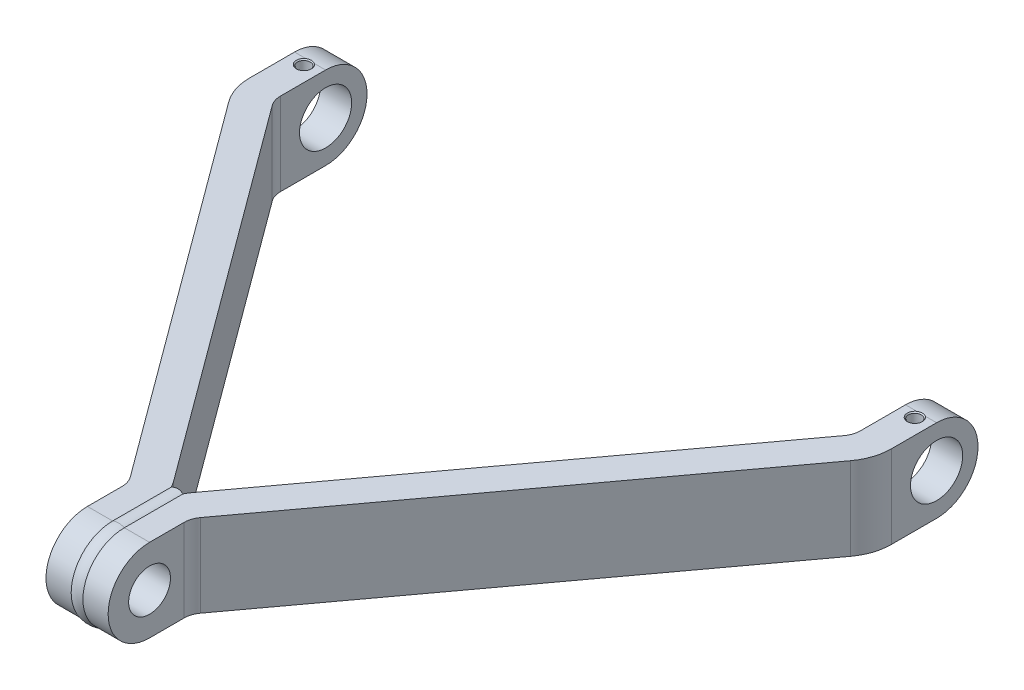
ISO-10303-21;
HEADER;
FILE_DESCRIPTION(('STEP AP214'),'2;1');
FILE_NAME('part.step','',(''),(''),'','','');
FILE_SCHEMA(('AUTOMOTIVE_DESIGN { 1 0 10303 214 1 1 1 1 }'));
ENDSEC;
DATA;
#1=APPLICATION_CONTEXT('core data for automotive mechanical design processes');
#2=APPLICATION_PROTOCOL_DEFINITION('international standard','automotive_design',2000,#1);
#3=PRODUCT_CONTEXT('',#1,'mechanical');
#4=PRODUCT('Part','Part','',(#3));
#5=PRODUCT_RELATED_PRODUCT_CATEGORY('part','',(#4));
#6=PRODUCT_DEFINITION_FORMATION('','',#4);
#7=PRODUCT_DEFINITION_CONTEXT('part definition',#1,'design');
#8=PRODUCT_DEFINITION('design','',#6,#7);
#9=PRODUCT_DEFINITION_SHAPE('','',#8);
#10=(LENGTH_UNIT() NAMED_UNIT(*) SI_UNIT(.MILLI.,.METRE.));
#11=(NAMED_UNIT(*) PLANE_ANGLE_UNIT() SI_UNIT($,.RADIAN.));
#12=(NAMED_UNIT(*) SI_UNIT($,.STERADIAN.) SOLID_ANGLE_UNIT());
#13=UNCERTAINTY_MEASURE_WITH_UNIT(LENGTH_MEASURE(1.E-05),#10,'distance_accuracy_value','');
#14=(GEOMETRIC_REPRESENTATION_CONTEXT(3) GLOBAL_UNCERTAINTY_ASSIGNED_CONTEXT((#13)) GLOBAL_UNIT_ASSIGNED_CONTEXT((#10,
#11,#12)) REPRESENTATION_CONTEXT('',''));
#15=CARTESIAN_POINT('',(0.,0.,0.));
#16=DIRECTION('',(0.,0.,1.));
#17=DIRECTION('',(1.,0.,0.));
#18=AXIS2_PLACEMENT_3D('',#15,#16,#17);
#19=CARTESIAN_POINT('',(-31.75,50.8,283.573625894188));
#20=DIRECTION('',(0.,-1.,0.));
#21=DIRECTION('',(0.,0.,-1.));
#22=AXIS2_PLACEMENT_3D('',#19,#20,#21);
#23=PLANE('',#22);
#24=CARTESIAN_POINT('',(-187.325,50.8,3.81));
#25=DIRECTION('',(0.,1.,0.));
#26=DIRECTION('',(0.,0.,1.));
#27=AXIS2_PLACEMENT_3D('',#24,#25,#26);
#28=CIRCLE('',#27,4.6029118);
#29=CARTESIAN_POINT('',(-189.907769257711,50.8,0.));
#30=VERTEX_POINT('',#29);
#31=CARTESIAN_POINT('',(-184.742230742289,50.8,0.));
#32=VERTEX_POINT('',#31);
#33=EDGE_CURVE('E61',#30,#32,#28,.T.);
#34=ORIENTED_EDGE('',*,*,#33,.F.);
#35=DIRECTION('',(-1.,0.,0.));
#36=VECTOR('',#35,1.);
#37=CARTESIAN_POINT('',(-31.7500000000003,50.8,-1.66533453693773E-13));
#38=LINE('',#37,#36);
#39=CARTESIAN_POINT('',(-196.85,50.8,0.));
#40=VERTEX_POINT('',#39);
#41=EDGE_CURVE('E368',#30,#40,#38,.T.);
#42=ORIENTED_EDGE('',*,*,#41,.T.);
#43=DIRECTION('',(0.,0.,1.));
#44=VECTOR('',#43,1.);
#45=CARTESIAN_POINT('',(-196.85,50.8,-25.4));
#46=LINE('',#45,#44);
#47=CARTESIAN_POINT('',(-196.85,50.8,27.66593526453));
#48=VERTEX_POINT('',#47);
#49=EDGE_CURVE('E525',#40,#48,#46,.T.);
#50=ORIENTED_EDGE('',*,*,#49,.T.);
#51=CARTESIAN_POINT('',(-165.1,50.8,27.6659352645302));
#52=DIRECTION('',(0.,1.,0.));
#53=DIRECTION('',(0.,0.,1.));
#54=AXIS2_PLACEMENT_3D('',#51,#52,#53);
#55=CIRCLE('',#54,31.75);
#56=CARTESIAN_POINT('',(-190.660522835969,50.8,46.500004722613));
#57=VERTEX_POINT('',#56);
#58=EDGE_CURVE('E529',#48,#57,#55,.T.);
#59=ORIENTED_EDGE('',*,*,#58,.T.);
#60=DIRECTION('',(0.59319903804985,0.,0.805055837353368));
#61=VECTOR('',#60,1.);
#62=CARTESIAN_POINT('',(-190.660522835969,50.8,46.500004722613));
#63=LINE('',#62,#61);
#64=CARTESIAN_POINT('',(-21.5257908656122,50.8,276.039998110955));
#65=VERTEX_POINT('',#64);
#66=EDGE_CURVE('E459',#57,#65,#63,.T.);
#67=ORIENTED_EDGE('',*,*,#66,.T.);
#68=CARTESIAN_POINT('',(-31.75,50.8,283.573625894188));
#69=DIRECTION('',(0.,-1.,0.));
#70=DIRECTION('',(0.,0.,-1.));
#71=AXIS2_PLACEMENT_3D('',#68,#69,#70);
#72=CIRCLE('',#71,12.7);
#73=CARTESIAN_POINT('',(-19.0499999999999,50.8,283.573625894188));
#74=VERTEX_POINT('',#73);
#75=EDGE_CURVE('E448',#65,#74,#72,.T.);
#76=ORIENTED_EDGE('',*,*,#75,.T.);
#77=DIRECTION('',(0.,0.,1.));
#78=VECTOR('',#77,1.);
#79=CARTESIAN_POINT('',(-19.05,50.8,283.573625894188));
#80=LINE('',#79,#78);
#81=CARTESIAN_POINT('',(-19.05,50.8,304.8));
#82=VERTEX_POINT('',#81);
#83=EDGE_CURVE('E446',#74,#82,#80,.T.);
#84=ORIENTED_EDGE('',*,*,#83,.T.);
#85=DIRECTION('',(1.,0.,0.));
#86=VECTOR('',#85,1.);
#87=CARTESIAN_POINT('',(-31.75,50.8,304.8));
#88=LINE('',#87,#86);
#89=CARTESIAN_POINT('',(-3.60107150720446,50.8,304.8));
#90=VERTEX_POINT('',#89);
#91=EDGE_CURVE('E398',#82,#90,#88,.T.);
#92=ORIENTED_EDGE('',*,*,#91,.T.);
#93=DIRECTION('',(0.,0.,-1.));
#94=VECTOR('',#93,1.);
#95=CARTESIAN_POINT('',(-3.60107150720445,50.8,304.8));
#96=LINE('',#95,#94);
#97=CARTESIAN_POINT('',(-3.60107150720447,50.8,268.886886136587));
#98=VERTEX_POINT('',#97);
#99=EDGE_CURVE('E272',#98,#90,#96,.F.);
#100=ORIENTED_EDGE('',*,*,#99,.F.);
#101=CARTESIAN_POINT('',(-31.75,50.8,283.573625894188));
#102=DIRECTION('',(0.,1.,0.));
#103=DIRECTION('',(0.,0.,-1.));
#104=AXIS2_PLACEMENT_3D('',#101,#102,#103);
#105=CIRCLE('',#104,31.75);
#106=CARTESIAN_POINT('',(-6.18947716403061,50.8,264.739556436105));
#107=VERTEX_POINT('',#106);
#108=EDGE_CURVE('E493',#98,#107,#105,.T.);
#109=ORIENTED_EDGE('',*,*,#108,.T.);
#110=DIRECTION('',(-0.59319903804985,0.,-0.805055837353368));
#111=VECTOR('',#110,1.);
#112=CARTESIAN_POINT('',(-175.324209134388,50.8,35.1995630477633));
#113=LINE('',#112,#111);
#114=CARTESIAN_POINT('',(-175.324209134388,50.8,35.1995630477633));
#115=VERTEX_POINT('',#114);
#116=EDGE_CURVE('E531',#107,#115,#113,.T.);
#117=ORIENTED_EDGE('',*,*,#116,.T.);
#118=CARTESIAN_POINT('',(-165.1,50.8,27.6659352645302));
#119=DIRECTION('',(0.,-1.,0.));
#120=DIRECTION('',(0.,0.,1.));
#121=AXIS2_PLACEMENT_3D('',#118,#119,#120);
#122=CIRCLE('',#121,12.7);
#123=CARTESIAN_POINT('',(-177.8,50.8,27.6659352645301));
#124=VERTEX_POINT('',#123);
#125=EDGE_CURVE('E515',#115,#124,#122,.T.);
#126=ORIENTED_EDGE('',*,*,#125,.T.);
#127=DIRECTION('',(0.,0.,-1.));
#128=VECTOR('',#127,1.);
#129=CARTESIAN_POINT('',(-177.8,50.8,0.));
#130=LINE('',#129,#128);
#131=CARTESIAN_POINT('',(-177.8,50.8,0.));
#132=VERTEX_POINT('',#131);
#133=EDGE_CURVE('E523',#124,#132,#130,.T.);
#134=ORIENTED_EDGE('',*,*,#133,.T.);
#135=EDGE_CURVE('E372',#132,#32,#38,.T.);
#136=ORIENTED_EDGE('',*,*,#135,.T.);
#137=EDGE_LOOP('',(#34,#42,#50,#59,#67,#76,#84,#92,#100,#109,#117,#126,#134,#136));
#138=FACE_BOUND('',#137,.T.);
#139=ADVANCED_FACE('F41',(#138),#23,.F.);
#140=CARTESIAN_POINT('',(-31.75,0.,283.573625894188));
#141=DIRECTION('',(0.,-1.,0.));
#142=DIRECTION('',(0.,0.,-1.));
#143=AXIS2_PLACEMENT_3D('',#140,#141,#142);
#144=PLANE('',#143);
#145=DIRECTION('',(0.,0.,1.));
#146=VECTOR('',#145,1.);
#147=CARTESIAN_POINT('',(3.60107150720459,0.,283.573625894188));
#148=LINE('',#147,#146);
#149=CARTESIAN_POINT('',(3.60107150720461,0.,268.886886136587));
#150=VERTEX_POINT('',#149);
#151=CARTESIAN_POINT('',(3.60107150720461,0.,304.8));
#152=VERTEX_POINT('',#151);
#153=EDGE_CURVE('E722',#150,#152,#148,.T.);
#154=ORIENTED_EDGE('',*,*,#153,.F.);
#155=CARTESIAN_POINT('',(31.7500000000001,0.,283.573625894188));
#156=DIRECTION('',(0.,-1.,0.));
#157=DIRECTION('',(0.,0.,-1.));
#158=AXIS2_PLACEMENT_3D('',#155,#156,#157);
#159=CIRCLE('',#158,31.75);
#160=CARTESIAN_POINT('',(6.18947716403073,0.,264.739556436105));
#161=VERTEX_POINT('',#160);
#162=EDGE_CURVE('E606',#150,#161,#159,.T.);
#163=ORIENTED_EDGE('',*,*,#162,.T.);
#164=DIRECTION('',(0.59319903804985,0.,-0.805055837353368));
#165=VECTOR('',#164,1.);
#166=CARTESIAN_POINT('',(175.324209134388,0.,35.1995630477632));
#167=LINE('',#166,#165);
#168=CARTESIAN_POINT('',(175.324209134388,0.,35.1995630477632));
#169=VERTEX_POINT('',#168);
#170=EDGE_CURVE('E644',#161,#169,#167,.T.);
#171=ORIENTED_EDGE('',*,*,#170,.T.);
#172=CARTESIAN_POINT('',(165.1,0.,27.6659352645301));
#173=DIRECTION('',(0.,1.,0.));
#174=DIRECTION('',(0.,0.,1.));
#175=AXIS2_PLACEMENT_3D('',#172,#173,#174);
#176=CIRCLE('',#175,12.7);
#177=CARTESIAN_POINT('',(177.8,0.,27.66593526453));
#178=VERTEX_POINT('',#177);
#179=EDGE_CURVE('E648',#169,#178,#176,.T.);
#180=ORIENTED_EDGE('',*,*,#179,.T.);
#181=DIRECTION('',(0.,0.,-1.));
#182=VECTOR('',#181,1.);
#183=CARTESIAN_POINT('',(177.8,0.,0.));
#184=LINE('',#183,#182);
#185=CARTESIAN_POINT('',(177.8,0.,0.));
#186=VERTEX_POINT('',#185);
#187=EDGE_CURVE('E652',#178,#186,#184,.T.);
#188=ORIENTED_EDGE('',*,*,#187,.T.);
#189=DIRECTION('',(-1.,0.,0.));
#190=VECTOR('',#189,1.);
#191=CARTESIAN_POINT('',(177.8,0.,0.));
#192=LINE('',#191,#190);
#193=CARTESIAN_POINT('',(196.85,0.,0.));
#194=VERTEX_POINT('',#193);
#195=EDGE_CURVE('E700',#194,#186,#192,.T.);
#196=ORIENTED_EDGE('',*,*,#195,.F.);
#197=DIRECTION('',(0.,0.,1.));
#198=VECTOR('',#197,1.);
#199=CARTESIAN_POINT('',(196.85,0.,-25.4000000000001));
#200=LINE('',#199,#198);
#201=CARTESIAN_POINT('',(196.85,0.,27.66593526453));
#202=VERTEX_POINT('',#201);
#203=EDGE_CURVE('E656',#194,#202,#200,.T.);
#204=ORIENTED_EDGE('',*,*,#203,.T.);
#205=CARTESIAN_POINT('',(165.1,0.,27.6659352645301));
#206=DIRECTION('',(0.,-1.,0.));
#207=DIRECTION('',(0.,0.,1.));
#208=AXIS2_PLACEMENT_3D('',#205,#206,#207);
#209=CIRCLE('',#208,31.75);
#210=CARTESIAN_POINT('',(190.660522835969,0.,46.5000047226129));
#211=VERTEX_POINT('',#210);
#212=EDGE_CURVE('E660',#202,#211,#209,.T.);
#213=ORIENTED_EDGE('',*,*,#212,.T.);
#214=DIRECTION('',(-0.59319903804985,0.,0.805055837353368));
#215=VECTOR('',#214,1.);
#216=CARTESIAN_POINT('',(190.660522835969,0.,46.5000047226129));
#217=LINE('',#216,#215);
#218=CARTESIAN_POINT('',(21.5257908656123,0.,276.039998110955));
#219=VERTEX_POINT('',#218);
#220=EDGE_CURVE('E664',#211,#219,#217,.T.);
#221=ORIENTED_EDGE('',*,*,#220,.T.);
#222=CARTESIAN_POINT('',(31.7500000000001,0.,283.573625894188));
#223=DIRECTION('',(0.,1.,0.));
#224=DIRECTION('',(0.,0.,-1.));
#225=AXIS2_PLACEMENT_3D('',#222,#223,#224);
#226=CIRCLE('',#225,12.7);
#227=CARTESIAN_POINT('',(19.0500000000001,0.,283.573625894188));
#228=VERTEX_POINT('',#227);
#229=EDGE_CURVE('E668',#219,#228,#226,.T.);
#230=ORIENTED_EDGE('',*,*,#229,.T.);
#231=DIRECTION('',(0.,0.,1.));
#232=VECTOR('',#231,1.);
#233=CARTESIAN_POINT('',(19.0500000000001,0.,283.573625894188));
#234=LINE('',#233,#232);
#235=CARTESIAN_POINT('',(19.0500000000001,0.,304.8));
#236=VERTEX_POINT('',#235);
#237=EDGE_CURVE('E611',#228,#236,#234,.T.);
#238=ORIENTED_EDGE('',*,*,#237,.T.);
#239=DIRECTION('',(1.,0.,0.));
#240=VECTOR('',#239,1.);
#241=CARTESIAN_POINT('',(19.0500000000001,0.,304.8));
#242=LINE('',#241,#240);
#243=EDGE_CURVE('E714',#152,#236,#242,.T.);
#244=ORIENTED_EDGE('',*,*,#243,.F.);
#245=EDGE_LOOP('',(#154,#163,#171,#180,#188,#196,#204,#213,#221,#230,#238,#244));
#246=FACE_BOUND('',#245,.T.);
#247=ADVANCED_FACE('F305',(#246),#144,.T.);
#248=CARTESIAN_POINT('',(-31.75,0.,283.573625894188));
#249=DIRECTION('',(0.,1.,0.));
#250=DIRECTION('',(0.,0.,-1.));
#251=AXIS2_PLACEMENT_3D('',#248,#249,#250);
#252=CIRCLE('',#251,31.75);
#253=CARTESIAN_POINT('',(-3.60107150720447,0.,268.886886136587));
#254=VERTEX_POINT('',#253);
#255=CARTESIAN_POINT('',(-6.18947716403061,0.,264.739556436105));
#256=VERTEX_POINT('',#255);
#257=EDGE_CURVE('E463',#254,#256,#252,.T.);
#258=ORIENTED_EDGE('',*,*,#257,.F.);
#259=DIRECTION('',(0.,0.,1.));
#260=VECTOR('',#259,1.);
#261=CARTESIAN_POINT('',(-3.60107150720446,0.,283.573625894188));
#262=LINE('',#261,#260);
#263=CARTESIAN_POINT('',(-3.60107150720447,0.,304.8));
#264=VERTEX_POINT('',#263);
#265=EDGE_CURVE('E408',#254,#264,#262,.T.);
#266=ORIENTED_EDGE('',*,*,#265,.T.);
#267=DIRECTION('',(-1.,0.,0.));
#268=VECTOR('',#267,1.);
#269=CARTESIAN_POINT('',(-19.05,0.,304.8));
#270=LINE('',#269,#268);
#271=CARTESIAN_POINT('',(-19.05,0.,304.8));
#272=VERTEX_POINT('',#271);
#273=EDGE_CURVE('E402',#264,#272,#270,.T.);
#274=ORIENTED_EDGE('',*,*,#273,.T.);
#275=DIRECTION('',(0.,0.,1.));
#276=VECTOR('',#275,1.);
#277=CARTESIAN_POINT('',(-19.05,0.,283.573625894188));
#278=LINE('',#277,#276);
#279=CARTESIAN_POINT('',(-19.0499999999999,0.,283.573625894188));
#280=VERTEX_POINT('',#279);
#281=EDGE_CURVE('E490',#280,#272,#278,.T.);
#282=ORIENTED_EDGE('',*,*,#281,.F.);
#283=CARTESIAN_POINT('',(-31.75,0.,283.573625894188));
#284=DIRECTION('',(0.,-1.,0.));
#285=DIRECTION('',(0.,0.,-1.));
#286=AXIS2_PLACEMENT_3D('',#283,#284,#285);
#287=CIRCLE('',#286,12.7);
#288=CARTESIAN_POINT('',(-21.5257908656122,0.,276.039998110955));
#289=VERTEX_POINT('',#288);
#290=EDGE_CURVE('E487',#289,#280,#287,.T.);
#291=ORIENTED_EDGE('',*,*,#290,.F.);
#292=DIRECTION('',(0.59319903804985,0.,0.805055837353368));
#293=VECTOR('',#292,1.);
#294=CARTESIAN_POINT('',(-190.660522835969,0.,46.500004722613));
#295=LINE('',#294,#293);
#296=CARTESIAN_POINT('',(-190.660522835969,0.,46.500004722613));
#297=VERTEX_POINT('',#296);
#298=EDGE_CURVE('E484',#297,#289,#295,.T.);
#299=ORIENTED_EDGE('',*,*,#298,.F.);
#300=CARTESIAN_POINT('',(-165.1,0.,27.6659352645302));
#301=DIRECTION('',(0.,1.,0.));
#302=DIRECTION('',(0.,0.,1.));
#303=AXIS2_PLACEMENT_3D('',#300,#301,#302);
#304=CIRCLE('',#303,31.75);
#305=CARTESIAN_POINT('',(-196.85,0.,27.66593526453));
#306=VERTEX_POINT('',#305);
#307=EDGE_CURVE('E481',#306,#297,#304,.T.);
#308=ORIENTED_EDGE('',*,*,#307,.F.);
#309=DIRECTION('',(0.,0.,1.));
#310=VECTOR('',#309,1.);
#311=CARTESIAN_POINT('',(-196.85,0.,-25.4));
#312=LINE('',#311,#310);
#313=CARTESIAN_POINT('',(-196.85,0.,0.));
#314=VERTEX_POINT('',#313);
#315=EDGE_CURVE('E478',#314,#306,#312,.T.);
#316=ORIENTED_EDGE('',*,*,#315,.F.);
#317=DIRECTION('',(1.,0.,0.));
#318=VECTOR('',#317,1.);
#319=CARTESIAN_POINT('',(-177.8,0.,0.));
#320=LINE('',#319,#318);
#321=CARTESIAN_POINT('',(-177.8,0.,0.));
#322=VERTEX_POINT('',#321);
#323=EDGE_CURVE('E384',#314,#322,#320,.T.);
#324=ORIENTED_EDGE('',*,*,#323,.T.);
#325=DIRECTION('',(0.,0.,-1.));
#326=VECTOR('',#325,1.);
#327=CARTESIAN_POINT('',(-177.8,0.,0.));
#328=LINE('',#327,#326);
#329=CARTESIAN_POINT('',(-177.8,0.,27.6659352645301));
#330=VERTEX_POINT('',#329);
#331=EDGE_CURVE('E474',#330,#322,#328,.T.);
#332=ORIENTED_EDGE('',*,*,#331,.F.);
#333=CARTESIAN_POINT('',(-165.1,0.,27.6659352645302));
#334=DIRECTION('',(0.,-1.,0.));
#335=DIRECTION('',(0.,0.,1.));
#336=AXIS2_PLACEMENT_3D('',#333,#334,#335);
#337=CIRCLE('',#336,12.7);
#338=CARTESIAN_POINT('',(-175.324209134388,0.,35.1995630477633));
#339=VERTEX_POINT('',#338);
#340=EDGE_CURVE('E470',#339,#330,#337,.T.);
#341=ORIENTED_EDGE('',*,*,#340,.F.);
#342=DIRECTION('',(-0.59319903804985,0.,-0.805055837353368));
#343=VECTOR('',#342,1.);
#344=CARTESIAN_POINT('',(-175.324209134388,0.,35.1995630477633));
#345=LINE('',#344,#343);
#346=EDGE_CURVE('E466',#256,#339,#345,.T.);
#347=ORIENTED_EDGE('',*,*,#346,.F.);
#348=EDGE_LOOP('',(#258,#266,#274,#282,#291,#299,#308,#316,#324,#332,#341,#347));
#349=FACE_BOUND('',#348,.T.);
#350=ADVANCED_FACE('F303',(#349),#144,.T.);
#351=DIRECTION('',(1.,0.,0.));
#352=VECTOR('',#351,1.);
#353=CARTESIAN_POINT('',(31.7500000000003,50.8,-1.80646973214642E-13));
#354=LINE('',#353,#352);
#355=CARTESIAN_POINT('',(189.907769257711,50.8,0.));
#356=VERTEX_POINT('',#355);
#357=CARTESIAN_POINT('',(196.85,50.8,0.));
#358=VERTEX_POINT('',#357);
#359=EDGE_CURVE('E695',#356,#358,#354,.T.);
#360=ORIENTED_EDGE('',*,*,#359,.F.);
#361=CARTESIAN_POINT('',(187.325,50.8,3.81));
#362=DIRECTION('',(0.,1.,0.));
#363=DIRECTION('',(0.,0.,1.));
#364=AXIS2_PLACEMENT_3D('',#361,#362,#363);
#365=CIRCLE('',#364,4.6029118);
#366=CARTESIAN_POINT('',(184.742230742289,50.8,0.));
#367=VERTEX_POINT('',#366);
#368=EDGE_CURVE('E263',#367,#356,#365,.T.);
#369=ORIENTED_EDGE('',*,*,#368,.F.);
#370=CARTESIAN_POINT('',(177.8,50.8,0.));
#371=VERTEX_POINT('',#370);
#372=EDGE_CURVE('E696',#371,#367,#354,.T.);
#373=ORIENTED_EDGE('',*,*,#372,.F.);
#374=DIRECTION('',(0.,0.,-1.));
#375=VECTOR('',#374,1.);
#376=CARTESIAN_POINT('',(177.8,50.8,0.));
#377=LINE('',#376,#375);
#378=CARTESIAN_POINT('',(177.8,50.8,27.66593526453));
#379=VERTEX_POINT('',#378);
#380=EDGE_CURVE('E619',#379,#371,#377,.T.);
#381=ORIENTED_EDGE('',*,*,#380,.F.);
#382=CARTESIAN_POINT('',(165.1,50.8,27.6659352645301));
#383=DIRECTION('',(0.,1.,0.));
#384=DIRECTION('',(0.,0.,1.));
#385=AXIS2_PLACEMENT_3D('',#382,#383,#384);
#386=CIRCLE('',#385,12.7);
#387=CARTESIAN_POINT('',(175.324209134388,50.8,35.1995630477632));
#388=VERTEX_POINT('',#387);
#389=EDGE_CURVE('E615',#388,#379,#386,.T.);
#390=ORIENTED_EDGE('',*,*,#389,.F.);
#391=DIRECTION('',(0.59319903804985,0.,-0.805055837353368));
#392=VECTOR('',#391,1.);
#393=CARTESIAN_POINT('',(175.324209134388,50.8,35.1995630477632));
#394=LINE('',#393,#392);
#395=CARTESIAN_POINT('',(6.18947716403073,50.8,264.739556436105));
#396=VERTEX_POINT('',#395);
#397=EDGE_CURVE('E610',#396,#388,#394,.T.);
#398=ORIENTED_EDGE('',*,*,#397,.F.);
#399=CARTESIAN_POINT('',(31.7500000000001,50.8,283.573625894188));
#400=DIRECTION('',(0.,-1.,0.));
#401=DIRECTION('',(0.,0.,-1.));
#402=AXIS2_PLACEMENT_3D('',#399,#400,#401);
#403=CIRCLE('',#402,31.75);
#404=CARTESIAN_POINT('',(3.60107150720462,50.8,268.886886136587));
#405=VERTEX_POINT('',#404);
#406=EDGE_CURVE('E607',#405,#396,#403,.T.);
#407=ORIENTED_EDGE('',*,*,#406,.F.);
#408=DIRECTION('',(0.,0.,-1.));
#409=VECTOR('',#408,1.);
#410=CARTESIAN_POINT('',(3.60107150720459,50.8,304.8));
#411=LINE('',#410,#409);
#412=CARTESIAN_POINT('',(3.60107150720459,50.8,304.8));
#413=VERTEX_POINT('',#412);
#414=EDGE_CURVE('E728',#405,#413,#411,.F.);
#415=ORIENTED_EDGE('',*,*,#414,.T.);
#416=DIRECTION('',(-1.,0.,0.));
#417=VECTOR('',#416,1.);
#418=CARTESIAN_POINT('',(31.7500000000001,50.8,304.8));
#419=LINE('',#418,#417);
#420=CARTESIAN_POINT('',(19.0500000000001,50.8,304.8));
#421=VERTEX_POINT('',#420);
#422=EDGE_CURVE('E711',#421,#413,#419,.T.);
#423=ORIENTED_EDGE('',*,*,#422,.F.);
#424=DIRECTION('',(0.,0.,1.));
#425=VECTOR('',#424,1.);
#426=CARTESIAN_POINT('',(19.0500000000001,50.8,283.573625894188));
#427=LINE('',#426,#425);
#428=CARTESIAN_POINT('',(19.0500000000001,50.8,283.573625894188));
#429=VERTEX_POINT('',#428);
#430=EDGE_CURVE('E638',#429,#421,#427,.T.);
#431=ORIENTED_EDGE('',*,*,#430,.F.);
#432=CARTESIAN_POINT('',(31.7500000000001,50.8,283.573625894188));
#433=DIRECTION('',(0.,1.,0.));
#434=DIRECTION('',(0.,0.,-1.));
#435=AXIS2_PLACEMENT_3D('',#432,#433,#434);
#436=CIRCLE('',#435,12.7);
#437=CARTESIAN_POINT('',(21.5257908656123,50.8,276.039998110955));
#438=VERTEX_POINT('',#437);
#439=EDGE_CURVE('E634',#438,#429,#436,.T.);
#440=ORIENTED_EDGE('',*,*,#439,.F.);
#441=DIRECTION('',(-0.59319903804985,0.,0.805055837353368));
#442=VECTOR('',#441,1.);
#443=CARTESIAN_POINT('',(190.660522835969,50.8,46.5000047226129));
#444=LINE('',#443,#442);
#445=CARTESIAN_POINT('',(190.660522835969,50.8,46.5000047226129));
#446=VERTEX_POINT('',#445);
#447=EDGE_CURVE('E630',#446,#438,#444,.T.);
#448=ORIENTED_EDGE('',*,*,#447,.F.);
#449=CARTESIAN_POINT('',(165.1,50.8,27.6659352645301));
#450=DIRECTION('',(0.,-1.,0.));
#451=DIRECTION('',(0.,0.,1.));
#452=AXIS2_PLACEMENT_3D('',#449,#450,#451);
#453=CIRCLE('',#452,31.75);
#454=CARTESIAN_POINT('',(196.85,50.8,27.66593526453));
#455=VERTEX_POINT('',#454);
#456=EDGE_CURVE('E626',#455,#446,#453,.T.);
#457=ORIENTED_EDGE('',*,*,#456,.F.);
#458=DIRECTION('',(0.,0.,1.));
#459=VECTOR('',#458,1.);
#460=CARTESIAN_POINT('',(196.85,50.8,-25.4000000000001));
#461=LINE('',#460,#459);
#462=EDGE_CURVE('E622',#358,#455,#461,.T.);
#463=ORIENTED_EDGE('',*,*,#462,.F.);
#464=EDGE_LOOP('',(#360,#369,#373,#381,#390,#398,#407,#415,#423,#431,#440,#448,#457,#463));
#465=FACE_BOUND('',#464,.T.);
#466=ADVANCED_FACE('F298',(#465),#23,.F.);
#467=CARTESIAN_POINT('',(-19.05,25.4,304.8));
#468=DIRECTION('',(1.,0.,0.));
#469=DIRECTION('',(0.,0.,-1.));
#470=AXIS2_PLACEMENT_3D('',#467,#468,#469);
#471=CYLINDRICAL_SURFACE('',#470,25.4);
#472=ORIENTED_EDGE('',*,*,#273,.F.);
#473=CARTESIAN_POINT('',(-3.60107150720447,25.4,304.8));
#474=DIRECTION('',(1.,0.,0.));
#475=DIRECTION('',(0.,0.,-1.));
#476=AXIS2_PLACEMENT_3D('',#473,#474,#475);
#477=CIRCLE('',#476,25.4);
#478=EDGE_CURVE('E432',#264,#90,#477,.F.);
#479=ORIENTED_EDGE('',*,*,#478,.T.);
#480=ORIENTED_EDGE('',*,*,#91,.F.);
#481=CARTESIAN_POINT('',(-19.05,25.4,304.8));
#482=DIRECTION('',(1.,0.,0.));
#483=DIRECTION('',(0.,0.,-1.));
#484=AXIS2_PLACEMENT_3D('',#481,#482,#483);
#485=CIRCLE('',#484,25.4);
#486=EDGE_CURVE('E405',#272,#82,#485,.F.);
#487=ORIENTED_EDGE('',*,*,#486,.F.);
#488=EDGE_LOOP('',(#472,#479,#480,#487));
#489=FACE_BOUND('',#488,.T.);
#490=ADVANCED_FACE('F302',(#489),#471,.T.);
#491=CARTESIAN_POINT('',(-196.85,25.4,304.8));
#492=DIRECTION('',(1.,0.,0.));
#493=DIRECTION('',(0.,0.,-1.));
#494=AXIS2_PLACEMENT_3D('',#491,#492,#493);
#495=CYLINDRICAL_SURFACE('',#494,12.827);
#496=CARTESIAN_POINT('',(-19.05,25.4,304.8));
#497=DIRECTION('',(1.,0.,0.));
#498=DIRECTION('',(0.,0.,-1.));
#499=AXIS2_PLACEMENT_3D('',#496,#497,#498);
#500=CIRCLE('',#499,12.827);
#501=CARTESIAN_POINT('',(-19.05,25.4,291.973));
#502=VERTEX_POINT('',#501);
#503=EDGE_CURVE('E762',#502,#502,#500,.T.);
#504=ORIENTED_EDGE('',*,*,#503,.F.);
#505=EDGE_LOOP('',(#504));
#506=FACE_BOUND('',#505,.T.);
#507=CARTESIAN_POINT('',(-0.507999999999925,25.4,304.8));
#508=DIRECTION('',(1.,0.,0.));
#509=DIRECTION('',(0.,0.,-1.));
#510=AXIS2_PLACEMENT_3D('',#507,#508,#509);
#511=CIRCLE('',#510,12.827);
#512=CARTESIAN_POINT('',(-0.507999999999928,25.4,291.973));
#513=VERTEX_POINT('',#512);
#514=EDGE_CURVE('E409',#513,#513,#511,.F.);
#515=ORIENTED_EDGE('',*,*,#514,.F.);
#516=EDGE_LOOP('',(#515));
#517=FACE_BOUND('',#516,.T.);
#518=ADVANCED_FACE('F296',(#506,#517),#495,.F.);
#519=CARTESIAN_POINT('',(-177.8,25.4,0.));
#520=DIRECTION('',(-1.,0.,0.));
#521=DIRECTION('',(0.,0.,1.));
#522=AXIS2_PLACEMENT_3D('',#519,#520,#521);
#523=CYLINDRICAL_SURFACE('',#522,25.4);
#524=CARTESIAN_POINT('',(-184.628899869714,50.7998756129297,0.079491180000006));
#525=CARTESIAN_POINT('',(-184.721407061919,50.8000836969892,0.0123769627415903));
#526=CARTESIAN_POINT('',(-184.816533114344,50.8000183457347,-0.0510367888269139));
#527=CARTESIAN_POINT('',(-185.011392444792,50.7994996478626,-0.170258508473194));
#528=CARTESIAN_POINT('',(-185.111124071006,50.7990464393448,-0.226069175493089));
#529=CARTESIAN_POINT('',(-185.415982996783,50.7973452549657,-0.381652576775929));
#530=CARTESIAN_POINT('',(-185.627143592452,50.7957552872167,-0.469842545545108));
#531=CARTESIAN_POINT('',(-186.081563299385,50.7925293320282,-0.621123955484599));
#532=CARTESIAN_POINT('',(-186.325930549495,50.7909043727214,-0.680866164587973));
#533=CARTESIAN_POINT('',(-186.821238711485,50.7886369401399,-0.760724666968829));
#534=CARTESIAN_POINT('',(-187.072184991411,50.7879952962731,-0.780807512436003));
#535=CARTESIAN_POINT('',(-187.586793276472,50.7879905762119,-0.781006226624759));
#536=CARTESIAN_POINT('',(-187.850458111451,50.788693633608,-0.759054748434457));
#537=CARTESIAN_POINT('',(-188.370253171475,50.7911643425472,-0.671338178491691));
#538=CARTESIAN_POINT('',(-188.626388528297,50.7929312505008,-0.605603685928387));
#539=CARTESIAN_POINT('',(-189.07903977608,50.7961662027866,-0.446948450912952));
#540=CARTESIAN_POINT('',(-189.27800996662,50.7976310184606,-0.361017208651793));
#541=CARTESIAN_POINT('',(-189.565551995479,50.7991698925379,-0.211292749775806));
#542=CARTESIAN_POINT('',(-189.659625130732,50.799573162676,-0.157881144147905));
#543=CARTESIAN_POINT('',(-189.843617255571,50.8000246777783,-0.0442555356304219));
#544=CARTESIAN_POINT('',(-189.9335346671,50.8000727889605,0.0159610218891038));
#545=CARTESIAN_POINT('',(-190.021100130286,50.7998756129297,0.0794911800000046));
#546=B_SPLINE_CURVE_WITH_KNOTS('',3,(#524,#525,#526,#527,#528,#529,#530,#531,#532,#533,#534,
#535,#536,#537,#538,#539,#540,#541,#542,#543,#544,#545),.UNSPECIFIED.,.F.,.F.,(4,2,2,2,2,2,2,2,
2,2,4),(0.,0.342677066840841,0.685232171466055,1.36899208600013,2.12044628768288,
2.87253397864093,3.66256266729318,4.45203979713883,5.09993660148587,5.42421212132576,
5.74860978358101),.UNSPECIFIED.);
#547=EDGE_CURVE('E11',#32,#30,#546,.T.);
#548=ORIENTED_EDGE('',*,*,#547,.F.);
#549=ORIENTED_EDGE('',*,*,#135,.F.);
#550=CARTESIAN_POINT('',(-177.8,25.4,0.));
#551=DIRECTION('',(-1.,0.,0.));
#552=DIRECTION('',(0.,0.,1.));
#553=AXIS2_PLACEMENT_3D('',#550,#551,#552);
#554=CIRCLE('',#553,25.4);
#555=EDGE_CURVE('E393',#322,#132,#554,.F.);
#556=ORIENTED_EDGE('',*,*,#555,.F.);
#557=ORIENTED_EDGE('',*,*,#323,.F.);
#558=CARTESIAN_POINT('',(-196.85,25.4,0.));
#559=DIRECTION('',(1.,0.,0.));
#560=DIRECTION('',(0.,0.,-1.));
#561=AXIS2_PLACEMENT_3D('',#558,#559,#560);
#562=CIRCLE('',#561,25.4);
#563=EDGE_CURVE('E377',#40,#314,#562,.F.);
#564=ORIENTED_EDGE('',*,*,#563,.F.);
#565=ORIENTED_EDGE('',*,*,#41,.F.);
#566=EDGE_LOOP('',(#548,#549,#556,#557,#564,#565));
#567=FACE_BOUND('',#566,.T.);
#568=ADVANCED_FACE('F342',(#567),#523,.T.);
#569=CARTESIAN_POINT('',(-31.75,50.8,283.573625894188));
#570=DIRECTION('',(0.,-1.,0.));
#571=DIRECTION('',(0.,0.,-1.));
#572=AXIS2_PLACEMENT_3D('',#569,#570,#571);
#573=CYLINDRICAL_SURFACE('',#572,31.75);
#574=ORIENTED_EDGE('',*,*,#108,.F.);
#575=DIRECTION('',(0.,1.,0.));
#576=VECTOR('',#575,1.);
#577=CARTESIAN_POINT('',(-3.60107150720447,-16.7492956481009,268.886886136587));
#578=LINE('',#577,#576);
#579=EDGE_CURVE('E555',#254,#98,#578,.T.);
#580=ORIENTED_EDGE('',*,*,#579,.F.);
#581=ORIENTED_EDGE('',*,*,#257,.T.);
#582=DIRECTION('',(0.,-1.,0.));
#583=VECTOR('',#582,1.);
#584=CARTESIAN_POINT('',(-6.18947716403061,50.8,264.739556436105));
#585=LINE('',#584,#583);
#586=EDGE_CURVE('E380',#107,#256,#585,.T.);
#587=ORIENTED_EDGE('',*,*,#586,.F.);
#588=EDGE_LOOP('',(#574,#580,#581,#587));
#589=FACE_BOUND('',#588,.T.);
#590=ADVANCED_FACE('F339',(#589),#573,.T.);
#591=CARTESIAN_POINT('',(-175.324209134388,50.8,35.1995630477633));
#592=DIRECTION('',(-0.805055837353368,0.,0.59319903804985));
#593=DIRECTION('',(0.59319903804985,0.,0.805055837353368));
#594=AXIS2_PLACEMENT_3D('',#591,#592,#593);
#595=PLANE('',#594);
#596=ORIENTED_EDGE('',*,*,#346,.T.);
#597=DIRECTION('',(0.,-1.,0.));
#598=VECTOR('',#597,1.);
#599=CARTESIAN_POINT('',(-175.324209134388,50.8,35.1995630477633));
#600=LINE('',#599,#598);
#601=EDGE_CURVE('E386',#115,#339,#600,.T.);
#602=ORIENTED_EDGE('',*,*,#601,.F.);
#603=ORIENTED_EDGE('',*,*,#116,.F.);
#604=ORIENTED_EDGE('',*,*,#586,.T.);
#605=EDGE_LOOP('',(#596,#602,#603,#604));
#606=FACE_BOUND('',#605,.T.);
#607=ADVANCED_FACE('F335',(#606),#595,.F.);
#608=CARTESIAN_POINT('',(-165.1,50.8,27.6659352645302));
#609=DIRECTION('',(0.,-1.,0.));
#610=DIRECTION('',(0.,0.,-1.));
#611=AXIS2_PLACEMENT_3D('',#608,#609,#610);
#612=CYLINDRICAL_SURFACE('',#611,12.7);
#613=ORIENTED_EDGE('',*,*,#340,.T.);
#614=DIRECTION('',(0.,-1.,0.));
#615=VECTOR('',#614,1.);
#616=CARTESIAN_POINT('',(-177.8,50.8,27.6659352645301));
#617=LINE('',#616,#615);
#618=EDGE_CURVE('E506',#124,#330,#617,.T.);
#619=ORIENTED_EDGE('',*,*,#618,.F.);
#620=ORIENTED_EDGE('',*,*,#125,.F.);
#621=ORIENTED_EDGE('',*,*,#601,.T.);
#622=EDGE_LOOP('',(#613,#619,#620,#621));
#623=FACE_BOUND('',#622,.T.);
#624=ADVANCED_FACE('F331',(#623),#612,.F.);
#625=CARTESIAN_POINT('',(-177.8,50.8,0.));
#626=DIRECTION('',(-1.,0.,0.));
#627=DIRECTION('',(0.,0.,1.));
#628=AXIS2_PLACEMENT_3D('',#625,#626,#627);
#629=PLANE('',#628);
#630=CARTESIAN_POINT('',(-177.8,25.4,0.));
#631=DIRECTION('',(-1.,0.,0.));
#632=DIRECTION('',(0.,0.,1.));
#633=AXIS2_PLACEMENT_3D('',#630,#631,#632);
#634=CIRCLE('',#633,16.002);
#635=CARTESIAN_POINT('',(-177.8,25.4,16.002));
#636=VERTEX_POINT('',#635);
#637=EDGE_CURVE('E467',#636,#636,#634,.T.);
#638=ORIENTED_EDGE('',*,*,#637,.T.);
#639=EDGE_LOOP('',(#638));
#640=FACE_BOUND('',#639,.T.);
#641=ORIENTED_EDGE('',*,*,#331,.T.);
#642=ORIENTED_EDGE('',*,*,#555,.T.);
#643=ORIENTED_EDGE('',*,*,#133,.F.);
#644=ORIENTED_EDGE('',*,*,#618,.T.);
#645=EDGE_LOOP('',(#641,#642,#643,#644));
#646=FACE_BOUND('',#645,.T.);
#647=ADVANCED_FACE('F327',(#640,#646),#629,.F.);
#648=CARTESIAN_POINT('',(-196.85,50.8,-25.4));
#649=DIRECTION('',(1.,0.,0.));
#650=DIRECTION('',(0.,0.,-1.));
#651=AXIS2_PLACEMENT_3D('',#648,#649,#650);
#652=PLANE('',#651);
#653=CARTESIAN_POINT('',(-196.85,25.4,0.));
#654=DIRECTION('',(1.,0.,0.));
#655=DIRECTION('',(0.,0.,-1.));
#656=AXIS2_PLACEMENT_3D('',#653,#654,#655);
#657=CIRCLE('',#656,16.002);
#658=CARTESIAN_POINT('',(-196.85,25.4,-16.002));
#659=VERTEX_POINT('',#658);
#660=EDGE_CURVE('E413',#659,#659,#657,.T.);
#661=ORIENTED_EDGE('',*,*,#660,.T.);
#662=EDGE_LOOP('',(#661));
#663=FACE_BOUND('',#662,.T.);
#664=ORIENTED_EDGE('',*,*,#49,.F.);
#665=ORIENTED_EDGE('',*,*,#563,.T.);
#666=ORIENTED_EDGE('',*,*,#315,.T.);
#667=DIRECTION('',(0.,-1.,0.));
#668=VECTOR('',#667,1.);
#669=CARTESIAN_POINT('',(-196.85,50.8,27.66593526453));
#670=LINE('',#669,#668);
#671=EDGE_CURVE('E502',#48,#306,#670,.T.);
#672=ORIENTED_EDGE('',*,*,#671,.F.);
#673=EDGE_LOOP('',(#664,#665,#666,#672));
#674=FACE_BOUND('',#673,.T.);
#675=ADVANCED_FACE('F323',(#663,#674),#652,.F.);
#676=CARTESIAN_POINT('',(-165.1,50.8,27.6659352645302));
#677=DIRECTION('',(0.,-1.,0.));
#678=DIRECTION('',(0.,0.,-1.));
#679=AXIS2_PLACEMENT_3D('',#676,#677,#678);
#680=CYLINDRICAL_SURFACE('',#679,31.75);
#681=ORIENTED_EDGE('',*,*,#307,.T.);
#682=DIRECTION('',(0.,-1.,0.));
#683=VECTOR('',#682,1.);
#684=CARTESIAN_POINT('',(-190.660522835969,50.8,46.500004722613));
#685=LINE('',#684,#683);
#686=EDGE_CURVE('E498',#57,#297,#685,.T.);
#687=ORIENTED_EDGE('',*,*,#686,.F.);
#688=ORIENTED_EDGE('',*,*,#58,.F.);
#689=ORIENTED_EDGE('',*,*,#671,.T.);
#690=EDGE_LOOP('',(#681,#687,#688,#689));
#691=FACE_BOUND('',#690,.T.);
#692=ADVANCED_FACE('F319',(#691),#680,.T.);
#693=CARTESIAN_POINT('',(-190.660522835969,50.8,46.500004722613));
#694=DIRECTION('',(0.805055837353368,0.,-0.59319903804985));
#695=DIRECTION('',(-0.59319903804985,0.,-0.805055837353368));
#696=AXIS2_PLACEMENT_3D('',#693,#694,#695);
#697=PLANE('',#696);
#698=ORIENTED_EDGE('',*,*,#298,.T.);
#699=DIRECTION('',(0.,-1.,0.));
#700=VECTOR('',#699,1.);
#701=CARTESIAN_POINT('',(-21.5257908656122,50.8,276.039998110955));
#702=LINE('',#701,#700);
#703=EDGE_CURVE('E457',#65,#289,#702,.T.);
#704=ORIENTED_EDGE('',*,*,#703,.F.);
#705=ORIENTED_EDGE('',*,*,#66,.F.);
#706=ORIENTED_EDGE('',*,*,#686,.T.);
#707=EDGE_LOOP('',(#698,#704,#705,#706));
#708=FACE_BOUND('',#707,.T.);
#709=ADVANCED_FACE('F315',(#708),#697,.F.);
#710=CARTESIAN_POINT('',(-31.75,50.8,283.573625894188));
#711=DIRECTION('',(0.,-1.,0.));
#712=DIRECTION('',(0.,0.,-1.));
#713=AXIS2_PLACEMENT_3D('',#710,#711,#712);
#714=CYLINDRICAL_SURFACE('',#713,12.7);
#715=ORIENTED_EDGE('',*,*,#290,.T.);
#716=DIRECTION('',(0.,-1.,0.));
#717=VECTOR('',#716,1.);
#718=CARTESIAN_POINT('',(-19.0499999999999,50.8,283.573625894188));
#719=LINE('',#718,#717);
#720=EDGE_CURVE('E453',#74,#280,#719,.T.);
#721=ORIENTED_EDGE('',*,*,#720,.F.);
#722=ORIENTED_EDGE('',*,*,#75,.F.);
#723=ORIENTED_EDGE('',*,*,#703,.T.);
#724=EDGE_LOOP('',(#715,#721,#722,#723));
#725=FACE_BOUND('',#724,.T.);
#726=ADVANCED_FACE('F311',(#725),#714,.F.);
#727=CARTESIAN_POINT('',(-19.05,50.8,283.573625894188));
#728=DIRECTION('',(1.,0.,0.));
#729=DIRECTION('',(0.,0.,-1.));
#730=AXIS2_PLACEMENT_3D('',#727,#728,#729);
#731=PLANE('',#730);
#732=ORIENTED_EDGE('',*,*,#503,.T.);
#733=EDGE_LOOP('',(#732));
#734=FACE_BOUND('',#733,.T.);
#735=ORIENTED_EDGE('',*,*,#281,.T.);
#736=ORIENTED_EDGE('',*,*,#486,.T.);
#737=ORIENTED_EDGE('',*,*,#83,.F.);
#738=ORIENTED_EDGE('',*,*,#720,.T.);
#739=EDGE_LOOP('',(#735,#736,#737,#738));
#740=FACE_BOUND('',#739,.T.);
#741=ADVANCED_FACE('F295',(#734,#740),#731,.F.);
#742=CARTESIAN_POINT('',(-196.85,25.4,0.));
#743=DIRECTION('',(1.,0.,0.));
#744=DIRECTION('',(0.,0.,-1.));
#745=AXIS2_PLACEMENT_3D('',#742,#743,#744);
#746=CYLINDRICAL_SURFACE('',#745,16.002);
#747=CARTESIAN_POINT('',(-184.2516,40.9418114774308,3.81000000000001));
#748=CARTESIAN_POINT('',(-184.251591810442,40.9626013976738,3.72522124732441));
#749=CARTESIAN_POINT('',(-184.255108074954,40.9826855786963,3.64026639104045));
#750=CARTESIAN_POINT('',(-184.269214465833,41.0213481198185,3.47059128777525));
#751=CARTESIAN_POINT('',(-184.279805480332,41.039926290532,3.38587107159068));
#752=CARTESIAN_POINT('',(-184.308085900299,41.0754766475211,3.21727627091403));
#753=CARTESIAN_POINT('',(-184.325775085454,41.0924488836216,3.13340166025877));
#754=CARTESIAN_POINT('',(-184.368182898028,41.1247318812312,2.96715313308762));
#755=CARTESIAN_POINT('',(-184.392901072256,41.1400427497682,2.88477912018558));
#756=CARTESIAN_POINT('',(-184.47755428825,41.1834842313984,2.64061489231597));
#757=CARTESIAN_POINT('',(-184.547974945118,41.2091073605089,2.48186091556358));
#758=CARTESIAN_POINT('',(-184.714956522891,41.2538371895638,2.17796293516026));
#759=CARTESIAN_POINT('',(-184.811503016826,41.2729474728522,2.03281147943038));
#760=CARTESIAN_POINT('',(-185.026265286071,41.3051738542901,1.7628473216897));
#761=CARTESIAN_POINT('',(-185.144082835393,41.3183867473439,1.63772960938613));
#762=CARTESIAN_POINT('',(-185.399172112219,41.3402925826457,1.40867275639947));
#763=CARTESIAN_POINT('',(-185.536448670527,41.3489844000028,1.30473889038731));
#764=CARTESIAN_POINT('',(-185.826248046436,41.3629278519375,1.12134279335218));
#765=CARTESIAN_POINT('',(-185.97874040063,41.368186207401,1.04183291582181));
#766=CARTESIAN_POINT('',(-186.294876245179,41.3762821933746,0.90930896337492));
#767=CARTESIAN_POINT('',(-186.458518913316,41.3791200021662,0.856292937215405));
#768=CARTESIAN_POINT('',(-186.793168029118,41.3831214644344,0.778068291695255));
#769=CARTESIAN_POINT('',(-186.964205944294,41.3842770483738,0.752993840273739));
#770=CARTESIAN_POINT('',(-187.308076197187,41.3852605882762,0.731822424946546));
#771=CARTESIAN_POINT('',(-187.480908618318,41.3850884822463,0.735726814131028));
#772=CARTESIAN_POINT('',(-187.823817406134,41.3833560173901,0.77244169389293));
#773=CARTESIAN_POINT('',(-187.993887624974,41.3817929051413,0.805309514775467));
#774=CARTESIAN_POINT('',(-188.326084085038,41.3767903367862,0.899088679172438));
#775=CARTESIAN_POINT('',(-188.488210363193,41.3733508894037,0.959999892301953));
#776=CARTESIAN_POINT('',(-188.799789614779,41.3637618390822,1.10805392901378));
#777=CARTESIAN_POINT('',(-188.94925105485,41.3576140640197,1.19517904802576));
#778=CARTESIAN_POINT('',(-189.231336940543,41.3415515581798,1.39311163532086));
#779=CARTESIAN_POINT('',(-189.363962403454,41.3316370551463,1.50391767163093));
#780=CARTESIAN_POINT('',(-189.608099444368,41.3069873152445,1.74539221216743));
#781=CARTESIAN_POINT('',(-189.719693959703,41.2922716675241,1.87597886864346));
#782=CARTESIAN_POINT('',(-189.919347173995,41.2570619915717,2.15339182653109));
#783=CARTESIAN_POINT('',(-190.00740288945,41.2365672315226,2.30022018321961));
#784=CARTESIAN_POINT('',(-190.157479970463,41.1892665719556,2.60514957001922));
#785=CARTESIAN_POINT('',(-190.21957055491,41.1624777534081,2.76321929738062));
#786=CARTESIAN_POINT('',(-190.316699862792,41.1024290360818,3.08619579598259));
#787=CARTESIAN_POINT('',(-190.35176480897,41.0691754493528,3.25109577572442));
#788=CARTESIAN_POINT('',(-190.38160039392,41.0186369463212,3.48234415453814));
#789=CARTESIAN_POINT('',(-190.387913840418,41.0038694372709,3.5479304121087));
#790=CARTESIAN_POINT('',(-190.396307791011,40.9734776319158,3.67903615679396));
#791=CARTESIAN_POINT('',(-190.398396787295,40.9578551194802,3.74455551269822));
#792=CARTESIAN_POINT('',(-190.3984,40.9418114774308,3.81000000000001));
#793=B_SPLINE_CURVE_WITH_KNOTS('',3,(#747,#748,#749,#750,#751,#752,#753,#754,#755,#756,#757,
#758,#759,#760,#761,#762,#763,#764,#765,#766,#767,#768,#769,#770,#771,#772,#773,#774,#775,#776,
#777,#778,#779,#780,#781,#782,#783,#784,#785,#786,#787,#788,#789,#790,#791,#792),.UNSPECIFIED.,
.F.,.F.,(4,2,2,2,2,2,2,2,2,2,2,2,2,2,2,2,2,2,2,2,2,2,4),(0.,0.261801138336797,0.523635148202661,
0.785461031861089,1.04727003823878,1.57112846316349,2.09469819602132,2.60932641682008,
3.12408262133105,3.63782816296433,4.15153586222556,4.66769975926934,5.18388775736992,
5.70109980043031,6.21830943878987,6.73517054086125,7.25200039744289,7.76674736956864,
8.28155955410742,8.79499044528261,9.30792252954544,9.51038684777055,9.71244375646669),.UNSPECIFIED.);
#794=CARTESIAN_POINT('',(-184.2516,40.9418114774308,3.81000000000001));
#795=VERTEX_POINT('',#794);
#796=CARTESIAN_POINT('',(-190.3984,40.9418114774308,3.81000000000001));
#797=VERTEX_POINT('',#796);
#798=EDGE_CURVE('E258',#795,#797,#793,.T.);
#799=ORIENTED_EDGE('',*,*,#798,.T.);
#800=CARTESIAN_POINT('',(-190.596336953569,41.1266799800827,2.95559483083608));
#801=CARTESIAN_POINT('',(-190.591617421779,41.1123842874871,3.03167985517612));
#802=CARTESIAN_POINT('',(-190.583521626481,41.0975768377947,3.10740807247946));
#803=CARTESIAN_POINT('',(-190.560867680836,41.0670842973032,3.25765657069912));
#804=CARTESIAN_POINT('',(-190.546314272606,41.0513998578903,3.33217769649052));
#805=CARTESIAN_POINT('',(-190.493580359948,41.0033954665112,3.55253704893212));
#806=CARTESIAN_POINT('',(-190.446267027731,40.9699625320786,3.69602641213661));
#807=CARTESIAN_POINT('',(-190.328946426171,40.900823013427,3.97615138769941));
#808=CARTESIAN_POINT('',(-190.258509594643,40.8650845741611,4.11259578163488));
#809=CARTESIAN_POINT('',(-190.098077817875,40.7933078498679,4.37360673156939));
#810=CARTESIAN_POINT('',(-190.008051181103,40.7572691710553,4.49815356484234));
#811=CARTESIAN_POINT('',(-189.796491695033,40.6811209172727,4.75092215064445));
#812=CARTESIAN_POINT('',(-189.672266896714,40.6411995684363,4.87695304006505));
#813=CARTESIAN_POINT('',(-189.405019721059,40.5651411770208,5.10855939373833));
#814=CARTESIAN_POINT('',(-189.261989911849,40.5290056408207,5.21412672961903));
#815=CARTESIAN_POINT('',(-188.947857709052,40.4601005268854,5.41008883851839));
#816=CARTESIAN_POINT('',(-188.775418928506,40.4278424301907,5.49855587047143));
#817=CARTESIAN_POINT('',(-188.506594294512,40.3869535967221,5.608630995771));
#818=CARTESIAN_POINT('',(-188.415253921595,40.3745703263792,5.64156025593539));
#819=CARTESIAN_POINT('',(-188.229785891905,40.3526085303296,5.69951472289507));
#820=CARTESIAN_POINT('',(-188.135659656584,40.3430286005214,5.72454388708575));
#821=CARTESIAN_POINT('',(-187.949277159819,40.3272746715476,5.76549524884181));
#822=CARTESIAN_POINT('',(-187.857104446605,40.3209762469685,5.78175114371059));
#823=CARTESIAN_POINT('',(-187.671600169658,40.3113772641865,5.80646269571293));
#824=CARTESIAN_POINT('',(-187.578269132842,40.3080753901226,5.81492177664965));
#825=CARTESIAN_POINT('',(-187.391181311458,40.3045607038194,5.82392460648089));
#826=CARTESIAN_POINT('',(-187.297424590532,40.3043474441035,5.8244695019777));
#827=CARTESIAN_POINT('',(-187.110248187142,40.3070146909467,5.81763957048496));
#828=CARTESIAN_POINT('',(-187.016828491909,40.3098950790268,5.81026504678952));
#829=CARTESIAN_POINT('',(-186.837190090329,40.3183785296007,5.78844653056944));
#830=CARTESIAN_POINT('',(-186.750901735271,40.3237901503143,5.77449916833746));
#831=CARTESIAN_POINT('',(-186.579850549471,40.3371070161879,5.73996288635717));
#832=CARTESIAN_POINT('',(-186.495088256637,40.3450131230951,5.71937167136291));
#833=CARTESIAN_POINT('',(-186.243956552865,40.3722133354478,5.64796188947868));
#834=CARTESIAN_POINT('',(-186.080602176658,40.3949963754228,5.58748974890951));
#835=CARTESIAN_POINT('',(-185.760634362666,40.4489012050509,5.44066686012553));
#836=CARTESIAN_POINT('',(-185.604443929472,40.4802820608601,5.35350009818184));
#837=CARTESIAN_POINT('',(-185.308229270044,40.5487199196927,5.15665952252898));
#838=CARTESIAN_POINT('',(-185.168214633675,40.5857802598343,5.04697246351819));
#839=CARTESIAN_POINT('',(-184.898006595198,40.6661575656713,4.79861458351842));
#840=CARTESIAN_POINT('',(-184.769302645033,40.7097344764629,4.65840129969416));
#841=CARTESIAN_POINT('',(-184.538772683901,40.7980565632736,4.35756151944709));
#842=CARTESIAN_POINT('',(-184.436941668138,40.8428015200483,4.19693883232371));
#843=CARTESIAN_POINT('',(-184.280254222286,40.9231291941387,3.88811101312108));
#844=CARTESIAN_POINT('',(-184.220326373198,40.958961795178,3.74253762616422));
#845=CARTESIAN_POINT('',(-184.125921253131,41.0279515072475,3.4430351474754));
#846=CARTESIAN_POINT('',(-184.091363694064,41.0611167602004,3.2891340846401));
#847=CARTESIAN_POINT('',(-184.063084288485,41.1040410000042,3.07422087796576));
#848=CARTESIAN_POINT('',(-184.057332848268,41.115523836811,3.01499434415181));
#849=CARTESIAN_POINT('',(-184.053663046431,41.1266799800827,2.95559483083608));
#850=B_SPLINE_CURVE_WITH_KNOTS('',3,(#800,#801,#802,#803,#804,#805,#806,#807,#808,#809,#810,
#811,#812,#813,#814,#815,#816,#817,#818,#819,#820,#821,#822,#823,#824,#825,#826,#827,#828,#829,
#830,#831,#832,#833,#834,#835,#836,#837,#838,#839,#840,#841,#842,#843,#844,#845,#846,#847,#848,
#849),.UNSPECIFIED.,.F.,.F.,(4,2,2,2,2,2,2,2,2,2,2,2,2,2,2,2,2,2,2,2,2,2,2,2,4),(0.,
0.232515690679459,0.464860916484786,0.926967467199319,1.39819645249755,1.8701935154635,
2.41214102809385,2.9543033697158,3.54048387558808,3.83380387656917,4.12697671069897,
4.40803019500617,4.68896020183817,4.9698495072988,5.25072805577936,5.51314120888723,
5.77564511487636,6.3002338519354,6.84280445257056,7.38569508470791,7.96868777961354,
8.55157182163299,9.03398642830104,9.51486770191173,9.69654006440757),.UNSPECIFIED.);
#851=EDGE_CURVE('E56',#797,#795,#850,.T.);
#852=ORIENTED_EDGE('',*,*,#851,.T.);
#853=EDGE_LOOP('',(#799,#852));
#854=FACE_BOUND('',#853,.T.);
#855=ORIENTED_EDGE('',*,*,#660,.F.);
#856=EDGE_LOOP('',(#855));
#857=FACE_BOUND('',#856,.T.);
#858=ORIENTED_EDGE('',*,*,#637,.F.);
#859=EDGE_LOOP('',(#858));
#860=FACE_BOUND('',#859,.T.);
#861=ADVANCED_FACE('F266',(#854,#857,#860),#746,.F.);
#862=CARTESIAN_POINT('',(-0.507999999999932,25.4,304.8));
#863=DIRECTION('',(1.,0.,0.));
#864=DIRECTION('',(0.,0.,-1.));
#865=AXIS2_PLACEMENT_3D('',#862,#863,#864);
#866=PLANE('',#865);
#867=DIRECTION('',(0.,1.,0.));
#868=VECTOR('',#867,1.);
#869=CARTESIAN_POINT('',(-0.507999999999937,46.99,284.843625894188));
#870=LINE('',#869,#868);
#871=CARTESIAN_POINT('',(-0.507999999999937,3.81,284.843625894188));
#872=VERTEX_POINT('',#871);
#873=CARTESIAN_POINT('',(-0.507999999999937,46.99,284.843625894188));
#874=VERTEX_POINT('',#873);
#875=EDGE_CURVE('E443',#872,#874,#870,.T.);
#876=ORIENTED_EDGE('',*,*,#875,.T.);
#877=DIRECTION('',(0.,0.,1.));
#878=VECTOR('',#877,1.);
#879=CARTESIAN_POINT('',(-0.507999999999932,46.99,304.8));
#880=LINE('',#879,#878);
#881=CARTESIAN_POINT('',(-0.507999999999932,46.99,304.8));
#882=VERTEX_POINT('',#881);
#883=EDGE_CURVE('E736',#874,#882,#880,.T.);
#884=ORIENTED_EDGE('',*,*,#883,.T.);
#885=CARTESIAN_POINT('',(-0.507999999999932,25.4,304.8));
#886=DIRECTION('',(1.,0.,0.));
#887=DIRECTION('',(0.,0.,-1.));
#888=AXIS2_PLACEMENT_3D('',#885,#886,#887);
#889=CIRCLE('',#888,21.59);
#890=CARTESIAN_POINT('',(-0.507999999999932,3.81,304.8));
#891=VERTEX_POINT('',#890);
#892=EDGE_CURVE('E740',#882,#891,#889,.T.);
#893=ORIENTED_EDGE('',*,*,#892,.T.);
#894=DIRECTION('',(0.,0.,-1.));
#895=VECTOR('',#894,1.);
#896=CARTESIAN_POINT('',(-0.507999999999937,3.81,284.843625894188));
#897=LINE('',#896,#895);
#898=EDGE_CURVE('E744',#891,#872,#897,.T.);
#899=ORIENTED_EDGE('',*,*,#898,.T.);
#900=EDGE_LOOP('',(#876,#884,#893,#899));
#901=FACE_BOUND('',#900,.T.);
#902=ORIENTED_EDGE('',*,*,#514,.T.);
#903=EDGE_LOOP('',(#902));
#904=FACE_BOUND('',#903,.T.);
#905=ADVANCED_FACE('F294',(#901,#904),#866,.T.);
#906=CARTESIAN_POINT('',(-0.507999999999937,46.99,284.843625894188));
#907=DIRECTION('',(0.,0.,-1.));
#908=DIRECTION('',(-1.,0.,0.));
#909=AXIS2_PLACEMENT_3D('',#906,#907,#908);
#910=PLANE('',#909);
#911=DIRECTION('',(1.,0.,0.));
#912=VECTOR('',#911,1.);
#913=CARTESIAN_POINT('',(-0.507999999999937,3.81,284.843625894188));
#914=LINE('',#913,#912);
#915=CARTESIAN_POINT('',(0.508000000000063,3.81,284.843625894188));
#916=VERTEX_POINT('',#915);
#917=EDGE_CURVE('E414',#872,#916,#914,.T.);
#918=ORIENTED_EDGE('',*,*,#917,.T.);
#919=DIRECTION('',(0.,1.,0.));
#920=VECTOR('',#919,1.);
#921=CARTESIAN_POINT('',(0.508000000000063,46.99,284.843625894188));
#922=LINE('',#921,#920);
#923=CARTESIAN_POINT('',(0.508000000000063,46.99,284.843625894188));
#924=VERTEX_POINT('',#923);
#925=EDGE_CURVE('E567',#916,#924,#922,.T.);
#926=ORIENTED_EDGE('',*,*,#925,.T.);
#927=DIRECTION('',(1.,0.,0.));
#928=VECTOR('',#927,1.);
#929=CARTESIAN_POINT('',(-0.507999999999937,46.99,284.843625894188));
#930=LINE('',#929,#928);
#931=EDGE_CURVE('E748',#874,#924,#930,.T.);
#932=ORIENTED_EDGE('',*,*,#931,.F.);
#933=ORIENTED_EDGE('',*,*,#875,.F.);
#934=EDGE_LOOP('',(#918,#926,#932,#933));
#935=FACE_BOUND('',#934,.T.);
#936=ADVANCED_FACE('F941',(#935),#910,.F.);
#937=CARTESIAN_POINT('',(-0.507999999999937,3.81,284.843625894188));
#938=DIRECTION('',(0.,-1.,0.));
#939=DIRECTION('',(0.,0.,-1.));
#940=AXIS2_PLACEMENT_3D('',#937,#938,#939);
#941=PLANE('',#940);
#942=DIRECTION('',(1.,0.,0.));
#943=VECTOR('',#942,1.);
#944=CARTESIAN_POINT('',(-0.507999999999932,3.81,304.8));
#945=LINE('',#944,#943);
#946=CARTESIAN_POINT('',(0.508000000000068,3.81,304.8));
#947=VERTEX_POINT('',#946);
#948=EDGE_CURVE('E751',#891,#947,#945,.T.);
#949=ORIENTED_EDGE('',*,*,#948,.T.);
#950=DIRECTION('',(0.,0.,-1.));
#951=VECTOR('',#950,1.);
#952=CARTESIAN_POINT('',(0.508000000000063,3.81,284.843625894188));
#953=LINE('',#952,#951);
#954=EDGE_CURVE('E589',#947,#916,#953,.T.);
#955=ORIENTED_EDGE('',*,*,#954,.T.);
#956=ORIENTED_EDGE('',*,*,#917,.F.);
#957=ORIENTED_EDGE('',*,*,#898,.F.);
#958=EDGE_LOOP('',(#949,#955,#956,#957));
#959=FACE_BOUND('',#958,.T.);
#960=ADVANCED_FACE('F943',(#959),#941,.F.);
#961=CARTESIAN_POINT('',(-0.507999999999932,25.4,304.8));
#962=DIRECTION('',(1.,0.,0.));
#963=DIRECTION('',(0.,0.,-1.));
#964=AXIS2_PLACEMENT_3D('',#961,#962,#963);
#965=CYLINDRICAL_SURFACE('',#964,21.59);
#966=DIRECTION('',(1.,0.,0.));
#967=VECTOR('',#966,1.);
#968=CARTESIAN_POINT('',(-0.507999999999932,46.99,304.8));
#969=LINE('',#968,#967);
#970=CARTESIAN_POINT('',(0.508000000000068,46.99,304.8));
#971=VERTEX_POINT('',#970);
#972=EDGE_CURVE('E754',#882,#971,#969,.T.);
#973=ORIENTED_EDGE('',*,*,#972,.T.);
#974=CARTESIAN_POINT('',(0.508000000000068,25.4,304.8));
#975=DIRECTION('',(1.,0.,0.));
#976=DIRECTION('',(0.,0.,-1.));
#977=AXIS2_PLACEMENT_3D('',#974,#975,#976);
#978=CIRCLE('',#977,21.59);
#979=EDGE_CURVE('E585',#971,#947,#978,.T.);
#980=ORIENTED_EDGE('',*,*,#979,.T.);
#981=ORIENTED_EDGE('',*,*,#948,.F.);
#982=ORIENTED_EDGE('',*,*,#892,.F.);
#983=EDGE_LOOP('',(#973,#980,#981,#982));
#984=FACE_BOUND('',#983,.T.);
#985=ADVANCED_FACE('F946',(#984),#965,.F.);
#986=CARTESIAN_POINT('',(-0.507999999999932,46.99,304.8));
#987=DIRECTION('',(0.,1.,0.));
#988=DIRECTION('',(0.,0.,1.));
#989=AXIS2_PLACEMENT_3D('',#986,#987,#988);
#990=PLANE('',#989);
#991=ORIENTED_EDGE('',*,*,#931,.T.);
#992=DIRECTION('',(0.,0.,1.));
#993=VECTOR('',#992,1.);
#994=CARTESIAN_POINT('',(0.508000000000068,46.99,304.8));
#995=LINE('',#994,#993);
#996=EDGE_CURVE('E581',#924,#971,#995,.T.);
#997=ORIENTED_EDGE('',*,*,#996,.T.);
#998=ORIENTED_EDGE('',*,*,#972,.F.);
#999=ORIENTED_EDGE('',*,*,#883,.F.);
#1000=EDGE_LOOP('',(#991,#997,#998,#999));
#1001=FACE_BOUND('',#1000,.T.);
#1002=ADVANCED_FACE('F938',(#1001),#990,.F.);
#1003=CARTESIAN_POINT('',(0.,42.672,304.8));
#1004=DIRECTION('',(0.,0.,-1.));
#1005=DIRECTION('',(-1.,0.,0.));
#1006=AXIS2_PLACEMENT_3D('',#1003,#1004,#1005);
#1007=CYLINDRICAL_SURFACE('',#1006,8.89);
#1008=ORIENTED_EDGE('',*,*,#414,.F.);
#1009=CARTESIAN_POINT('',(-3.60107150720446,50.8,268.886886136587));
#1010=CARTESIAN_POINT('',(-3.40238213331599,50.8880532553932,268.838140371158));
#1011=CARTESIAN_POINT('',(-3.19971591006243,50.969102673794,268.792750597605));
#1012=CARTESIAN_POINT('',(-2.78750874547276,51.116508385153,268.709513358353));
#1013=CARTESIAN_POINT('',(-2.57796485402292,51.1828582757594,268.671669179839));
#1014=CARTESIAN_POINT('',(-2.1535643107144,51.3000165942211,268.604446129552));
#1015=CARTESIAN_POINT('',(-1.93871581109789,51.350847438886,268.575055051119));
#1016=CARTESIAN_POINT('',(-1.50484970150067,51.4364967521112,268.525333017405));
#1017=CARTESIAN_POINT('',(-1.2858328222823,51.4713180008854,268.505000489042));
#1018=CARTESIAN_POINT('',(-0.844369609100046,51.52461215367,268.473817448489));
#1019=CARTESIAN_POINT('',(-0.621914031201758,51.5430280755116,268.462999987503));
#1020=CARTESIAN_POINT('',(-0.175988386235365,51.5630594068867,268.451231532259));
#1021=CARTESIAN_POINT('',(0.0474816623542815,51.5646751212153,268.450280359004));
#1022=CARTESIAN_POINT('',(0.493664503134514,51.5510878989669,268.458265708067));
#1023=CARTESIAN_POINT('',(0.716377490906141,51.5358896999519,268.467199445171));
#1024=CARTESIAN_POINT('',(1.15940908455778,51.488885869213,268.494731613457));
#1025=CARTESIAN_POINT('',(1.37972808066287,51.4570829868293,268.513328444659));
#1026=CARTESIAN_POINT('',(1.77184990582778,51.3854310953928,268.55499867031));
#1027=CARTESIAN_POINT('',(1.94438407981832,51.3485455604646,268.57638574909));
#1028=CARTESIAN_POINT('',(2.28621993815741,51.2648027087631,268.624678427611));
#1029=CARTESIAN_POINT('',(2.45552186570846,51.2179461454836,268.651583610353));
#1030=CARTESIAN_POINT('',(2.79018415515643,51.1146078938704,268.710525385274));
#1031=CARTESIAN_POINT('',(2.95554564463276,51.0581289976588,268.742560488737));
#1032=CARTESIAN_POINT('',(3.28179812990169,50.9359143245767,268.811318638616));
#1033=CARTESIAN_POINT('',(3.44268953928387,50.870179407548,268.848041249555));
#1034=CARTESIAN_POINT('',(3.60107150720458,50.8,268.886886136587));
#1035=B_SPLINE_CURVE_WITH_KNOTS('',3,(#1009,#1010,#1011,#1012,#1013,#1014,#1015,#1016,#1017,
#1018,#1019,#1020,#1021,#1022,#1023,#1024,#1025,#1026,#1027,#1028,#1029,#1030,#1031,#1032,#1033,
#1034),.UNSPECIFIED.,.F.,.F.,(4,2,2,2,2,2,2,2,2,2,2,2,4),(0.,0.668076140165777,1.33644269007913,
2.00383918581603,2.67111973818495,3.34070908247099,4.01028627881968,4.67967486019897,
5.34895264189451,5.88174374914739,6.41449460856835,6.9470911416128,7.47963823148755),.UNSPECIFIED.);
#1036=EDGE_CURVE('E425',#98,#405,#1035,.T.);
#1037=ORIENTED_EDGE('',*,*,#1036,.F.);
#1038=ORIENTED_EDGE('',*,*,#99,.T.);
#1039=CARTESIAN_POINT('',(0.,42.672,304.8));
#1040=DIRECTION('',(0.,0.,1.));
#1041=DIRECTION('',(-1.,0.,0.));
#1042=AXIS2_PLACEMENT_3D('',#1039,#1040,#1041);
#1043=CIRCLE('',#1042,8.89);
#1044=EDGE_CURVE('E422',#413,#90,#1043,.T.);
#1045=ORIENTED_EDGE('',*,*,#1044,.F.);
#1046=EDGE_LOOP('',(#1008,#1037,#1038,#1045));
#1047=FACE_BOUND('',#1046,.T.);
#1048=ADVANCED_FACE('F421',(#1047),#1007,.T.);
#1049=CARTESIAN_POINT('',(0.,8.128,283.573625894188));
#1050=DIRECTION('',(0.,0.,1.));
#1051=DIRECTION('',(1.,0.,0.));
#1052=AXIS2_PLACEMENT_3D('',#1049,#1050,#1051);
#1053=CYLINDRICAL_SURFACE('',#1052,8.89);
#1054=ORIENTED_EDGE('',*,*,#265,.F.);
#1055=CARTESIAN_POINT('',(3.60107150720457,0.,268.886886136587));
#1056=CARTESIAN_POINT('',(3.40238213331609,-0.0880532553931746,268.838140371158));
#1057=CARTESIAN_POINT('',(3.19971591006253,-0.169102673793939,268.792750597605));
#1058=CARTESIAN_POINT('',(2.78750874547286,-0.316508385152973,268.709513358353));
#1059=CARTESIAN_POINT('',(2.57796485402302,-0.382858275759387,268.671669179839));
#1060=CARTESIAN_POINT('',(2.15356431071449,-0.500016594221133,268.604446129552));
#1061=CARTESIAN_POINT('',(1.93871581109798,-0.550847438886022,268.575055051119));
#1062=CARTESIAN_POINT('',(1.50484970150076,-0.636496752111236,268.525333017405));
#1063=CARTESIAN_POINT('',(1.2858328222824,-0.671318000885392,268.505000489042));
#1064=CARTESIAN_POINT('',(0.844369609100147,-0.724612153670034,268.473817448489));
#1065=CARTESIAN_POINT('',(0.62191403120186,-0.743028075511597,268.462999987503));
#1066=CARTESIAN_POINT('',(0.175988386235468,-0.763059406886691,268.451231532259));
#1067=CARTESIAN_POINT('',(-0.0474816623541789,-0.764675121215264,268.450280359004));
#1068=CARTESIAN_POINT('',(-0.493664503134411,-0.751087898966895,268.458265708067));
#1069=CARTESIAN_POINT('',(-0.716377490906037,-0.735889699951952,268.467199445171));
#1070=CARTESIAN_POINT('',(-1.15940908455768,-0.688885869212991,268.494731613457));
#1071=CARTESIAN_POINT('',(-1.37972808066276,-0.657082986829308,268.513328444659));
#1072=CARTESIAN_POINT('',(-1.77184990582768,-0.585431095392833,268.55499867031));
#1073=CARTESIAN_POINT('',(-1.94438407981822,-0.548545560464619,268.57638574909));
#1074=CARTESIAN_POINT('',(-2.2862199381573,-0.464802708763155,268.624678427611));
#1075=CARTESIAN_POINT('',(-2.45552186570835,-0.41794614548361,268.651583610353));
#1076=CARTESIAN_POINT('',(-2.79018415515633,-0.31460789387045,268.710525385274));
#1077=CARTESIAN_POINT('',(-2.95554564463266,-0.258128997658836,268.742560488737));
#1078=CARTESIAN_POINT('',(-3.28179812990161,-0.13591432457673,268.811318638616));
#1079=CARTESIAN_POINT('',(-3.44268953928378,-0.0701794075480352,268.848041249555));
#1080=CARTESIAN_POINT('',(-3.60107150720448,0.,268.886886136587));
#1081=B_SPLINE_CURVE_WITH_KNOTS('',3,(#1055,#1056,#1057,#1058,#1059,#1060,#1061,#1062,#1063,
#1064,#1065,#1066,#1067,#1068,#1069,#1070,#1071,#1072,#1073,#1074,#1075,#1076,#1077,#1078,#1079,
#1080),.UNSPECIFIED.,.F.,.F.,(4,2,2,2,2,2,2,2,2,2,2,2,4),(0.,0.668076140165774,1.33644269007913,
2.00383918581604,2.67111973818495,3.34070908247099,4.01028627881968,4.67967486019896,
5.34895264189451,5.88174374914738,6.41449460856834,6.94709114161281,7.47963823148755),.UNSPECIFIED.);
#1082=EDGE_CURVE('E549',#150,#254,#1081,.T.);
#1083=ORIENTED_EDGE('',*,*,#1082,.F.);
#1084=ORIENTED_EDGE('',*,*,#153,.T.);
#1085=CARTESIAN_POINT('',(0.,8.128,304.8));
#1086=DIRECTION('',(0.,0.,-1.));
#1087=DIRECTION('',(-1.,0.,0.));
#1088=AXIS2_PLACEMENT_3D('',#1085,#1086,#1087);
#1089=CIRCLE('',#1088,8.89);
#1090=EDGE_CURVE('E437',#152,#264,#1089,.T.);
#1091=ORIENTED_EDGE('',*,*,#1090,.T.);
#1092=EDGE_LOOP('',(#1054,#1083,#1084,#1091));
#1093=FACE_BOUND('',#1092,.T.);
#1094=ADVANCED_FACE('F547',(#1093),#1053,.T.);
#1095=CARTESIAN_POINT('',(0.,25.4,304.8));
#1096=DIRECTION('',(-1.,0.,0.));
#1097=DIRECTION('',(0.,0.,1.));
#1098=AXIS2_PLACEMENT_3D('',#1095,#1096,#1097);
#1099=TOROIDAL_SURFACE('',#1098,17.272,8.89);
#1100=ORIENTED_EDGE('',*,*,#478,.F.);
#1101=ORIENTED_EDGE('',*,*,#1090,.F.);
#1102=CARTESIAN_POINT('',(3.60107150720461,25.4,304.8));
#1103=DIRECTION('',(1.,0.,0.));
#1104=DIRECTION('',(0.,0.,-1.));
#1105=AXIS2_PLACEMENT_3D('',#1102,#1103,#1104);
#1106=CIRCLE('',#1105,25.4);
#1107=EDGE_CURVE('E434',#152,#413,#1106,.F.);
#1108=ORIENTED_EDGE('',*,*,#1107,.T.);
#1109=ORIENTED_EDGE('',*,*,#1044,.T.);
#1110=EDGE_LOOP('',(#1100,#1101,#1108,#1109));
#1111=FACE_BOUND('',#1110,.T.);
#1112=ADVANCED_FACE('F431',(#1111),#1099,.T.);
#1113=CARTESIAN_POINT('',(19.0500000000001,25.4,304.8));
#1114=DIRECTION('',(-1.,0.,0.));
#1115=DIRECTION('',(0.,0.,-1.));
#1116=AXIS2_PLACEMENT_3D('',#1113,#1114,#1115);
#1117=CYLINDRICAL_SURFACE('',#1116,25.4);
#1118=ORIENTED_EDGE('',*,*,#243,.T.);
#1119=CARTESIAN_POINT('',(19.0500000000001,25.4,304.8));
#1120=DIRECTION('',(1.,0.,0.));
#1121=DIRECTION('',(0.,0.,-1.));
#1122=AXIS2_PLACEMENT_3D('',#1119,#1120,#1121);
#1123=CIRCLE('',#1122,25.4);
#1124=EDGE_CURVE('E718',#236,#421,#1123,.F.);
#1125=ORIENTED_EDGE('',*,*,#1124,.T.);
#1126=ORIENTED_EDGE('',*,*,#422,.T.);
#1127=ORIENTED_EDGE('',*,*,#1107,.F.);
#1128=EDGE_LOOP('',(#1118,#1125,#1126,#1127));
#1129=FACE_BOUND('',#1128,.T.);
#1130=ADVANCED_FACE('F894',(#1129),#1117,.T.);
#1131=CARTESIAN_POINT('',(196.85,25.4,304.8));
#1132=DIRECTION('',(-1.,0.,0.));
#1133=DIRECTION('',(0.,0.,-1.));
#1134=AXIS2_PLACEMENT_3D('',#1131,#1132,#1133);
#1135=CYLINDRICAL_SURFACE('',#1134,12.827);
#1136=CARTESIAN_POINT('',(19.0500000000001,25.4,304.8));
#1137=DIRECTION('',(1.,0.,0.));
#1138=DIRECTION('',(0.,0.,-1.));
#1139=AXIS2_PLACEMENT_3D('',#1136,#1137,#1138);
#1140=CIRCLE('',#1139,12.827);
#1141=CARTESIAN_POINT('',(19.0500000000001,25.4,291.973));
#1142=VERTEX_POINT('',#1141);
#1143=EDGE_CURVE('E598',#1142,#1142,#1140,.T.);
#1144=ORIENTED_EDGE('',*,*,#1143,.T.);
#1145=EDGE_LOOP('',(#1144));
#1146=FACE_BOUND('',#1145,.T.);
#1147=CARTESIAN_POINT('',(0.508000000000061,25.4,304.8));
#1148=DIRECTION('',(1.,0.,0.));
#1149=DIRECTION('',(0.,0.,-1.));
#1150=AXIS2_PLACEMENT_3D('',#1147,#1148,#1149);
#1151=CIRCLE('',#1150,12.827);
#1152=CARTESIAN_POINT('',(0.508000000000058,25.4,291.973));
#1153=VERTEX_POINT('',#1152);
#1154=EDGE_CURVE('E593',#1153,#1153,#1151,.F.);
#1155=ORIENTED_EDGE('',*,*,#1154,.T.);
#1156=EDGE_LOOP('',(#1155));
#1157=FACE_BOUND('',#1156,.T.);
#1158=ADVANCED_FACE('F929',(#1146,#1157),#1135,.F.);
#1159=CARTESIAN_POINT('',(177.8,25.4,0.));
#1160=DIRECTION('',(1.,0.,0.));
#1161=DIRECTION('',(0.,0.,1.));
#1162=AXIS2_PLACEMENT_3D('',#1159,#1160,#1161);
#1163=CYLINDRICAL_SURFACE('',#1162,25.4);
#1164=CARTESIAN_POINT('',(190.021100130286,50.7998756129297,0.0794911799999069));
#1165=CARTESIAN_POINT('',(189.928592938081,50.8000836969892,0.0123769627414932));
#1166=CARTESIAN_POINT('',(189.833466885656,50.8000183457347,-0.0510367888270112));
#1167=CARTESIAN_POINT('',(189.638607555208,50.7994996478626,-0.170258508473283));
#1168=CARTESIAN_POINT('',(189.538875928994,50.7990464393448,-0.226069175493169));
#1169=CARTESIAN_POINT('',(189.234017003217,50.7973452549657,-0.381652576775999));
#1170=CARTESIAN_POINT('',(189.022856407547,50.7957552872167,-0.469842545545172));
#1171=CARTESIAN_POINT('',(188.568436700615,50.7925293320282,-0.621123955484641));
#1172=CARTESIAN_POINT('',(188.324069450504,50.7909043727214,-0.680866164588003));
#1173=CARTESIAN_POINT('',(187.828761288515,50.7886369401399,-0.760724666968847));
#1174=CARTESIAN_POINT('',(187.577815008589,50.7879952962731,-0.780807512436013));
#1175=CARTESIAN_POINT('',(187.063206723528,50.7879905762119,-0.781006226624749));
#1176=CARTESIAN_POINT('',(186.799541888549,50.788693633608,-0.759054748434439));
#1177=CARTESIAN_POINT('',(186.279746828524,50.7911643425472,-0.671338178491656));
#1178=CARTESIAN_POINT('',(186.023611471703,50.7929312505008,-0.605603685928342));
#1179=CARTESIAN_POINT('',(185.57096022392,50.7961662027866,-0.446948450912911));
#1180=CARTESIAN_POINT('',(185.37199003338,50.7976310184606,-0.361017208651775));
#1181=CARTESIAN_POINT('',(185.084448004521,50.7991698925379,-0.211292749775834));
#1182=CARTESIAN_POINT('',(184.990374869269,50.799573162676,-0.15788114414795));
#1183=CARTESIAN_POINT('',(184.806382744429,50.8000246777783,-0.0442555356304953));
#1184=CARTESIAN_POINT('',(184.7164653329,50.8000727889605,0.0159610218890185));
#1185=CARTESIAN_POINT('',(184.628899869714,50.7998756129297,0.0794911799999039));
#1186=B_SPLINE_CURVE_WITH_KNOTS('',3,(#1164,#1165,#1166,#1167,#1168,#1169,#1170,#1171,#1172,
#1173,#1174,#1175,#1176,#1177,#1178,#1179,#1180,#1181,#1182,#1183,#1184,#1185),.UNSPECIFIED.,
.F.,.F.,(4,2,2,2,2,2,2,2,2,2,4),(0.,0.342677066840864,0.685232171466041,1.36899208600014,
2.12044628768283,2.87253397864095,3.66256266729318,4.45203979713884,5.09993660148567,
5.42421212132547,5.74860978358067),.UNSPECIFIED.);
#1187=EDGE_CURVE('E269',#356,#367,#1186,.T.);
#1188=ORIENTED_EDGE('',*,*,#1187,.F.);
#1189=ORIENTED_EDGE('',*,*,#359,.T.);
#1190=CARTESIAN_POINT('',(196.85,25.4,0.));
#1191=DIRECTION('',(1.,0.,0.));
#1192=DIRECTION('',(0.,0.,-1.));
#1193=AXIS2_PLACEMENT_3D('',#1190,#1191,#1192);
#1194=CIRCLE('',#1193,25.4);
#1195=EDGE_CURVE('E708',#358,#194,#1194,.F.);
#1196=ORIENTED_EDGE('',*,*,#1195,.T.);
#1197=ORIENTED_EDGE('',*,*,#195,.T.);
#1198=CARTESIAN_POINT('',(177.8,25.4,0.));
#1199=DIRECTION('',(-1.,0.,0.));
#1200=DIRECTION('',(0.,0.,1.));
#1201=AXIS2_PLACEMENT_3D('',#1198,#1199,#1200);
#1202=CIRCLE('',#1201,25.4);
#1203=EDGE_CURVE('E704',#186,#371,#1202,.F.);
#1204=ORIENTED_EDGE('',*,*,#1203,.T.);
#1205=ORIENTED_EDGE('',*,*,#372,.T.);
#1206=EDGE_LOOP('',(#1188,#1189,#1196,#1197,#1204,#1205));
#1207=FACE_BOUND('',#1206,.T.);
#1208=ADVANCED_FACE('F776',(#1207),#1163,.T.);
#1209=CARTESIAN_POINT('',(31.7500000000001,50.8,283.573625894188));
#1210=DIRECTION('',(0.,-1.,0.));
#1211=DIRECTION('',(0.,0.,-1.));
#1212=AXIS2_PLACEMENT_3D('',#1209,#1210,#1211);
#1213=CYLINDRICAL_SURFACE('',#1212,31.75);
#1214=ORIENTED_EDGE('',*,*,#162,.F.);
#1215=DIRECTION('',(0.,1.,0.));
#1216=VECTOR('',#1215,1.);
#1217=CARTESIAN_POINT('',(3.60107150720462,-16.7492956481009,268.886886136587));
#1218=LINE('',#1217,#1216);
#1219=EDGE_CURVE('E557',#150,#405,#1218,.T.);
#1220=ORIENTED_EDGE('',*,*,#1219,.T.);
#1221=ORIENTED_EDGE('',*,*,#406,.T.);
#1222=DIRECTION('',(0.,-1.,0.));
#1223=VECTOR('',#1222,1.);
#1224=CARTESIAN_POINT('',(6.18947716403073,50.8,264.739556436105));
#1225=LINE('',#1224,#1223);
#1226=EDGE_CURVE('E691',#396,#161,#1225,.T.);
#1227=ORIENTED_EDGE('',*,*,#1226,.T.);
#1228=EDGE_LOOP('',(#1214,#1220,#1221,#1227));
#1229=FACE_BOUND('',#1228,.T.);
#1230=ADVANCED_FACE('F891',(#1229),#1213,.T.);
#1231=CARTESIAN_POINT('',(175.324209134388,50.8,35.1995630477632));
#1232=DIRECTION('',(0.805055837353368,0.,0.59319903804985));
#1233=DIRECTION('',(-0.59319903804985,0.,0.805055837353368));
#1234=AXIS2_PLACEMENT_3D('',#1231,#1232,#1233);
#1235=PLANE('',#1234);
#1236=ORIENTED_EDGE('',*,*,#170,.F.);
#1237=ORIENTED_EDGE('',*,*,#1226,.F.);
#1238=ORIENTED_EDGE('',*,*,#397,.T.);
#1239=DIRECTION('',(0.,-1.,0.));
#1240=VECTOR('',#1239,1.);
#1241=CARTESIAN_POINT('',(175.324209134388,50.8,35.1995630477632));
#1242=LINE('',#1241,#1240);
#1243=EDGE_CURVE('E688',#388,#169,#1242,.T.);
#1244=ORIENTED_EDGE('',*,*,#1243,.T.);
#1245=EDGE_LOOP('',(#1236,#1237,#1238,#1244));
#1246=FACE_BOUND('',#1245,.T.);
#1247=ADVANCED_FACE('F889',(#1246),#1235,.F.);
#1248=CARTESIAN_POINT('',(165.1,50.8,27.6659352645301));
#1249=DIRECTION('',(0.,-1.,0.));
#1250=DIRECTION('',(0.,0.,-1.));
#1251=AXIS2_PLACEMENT_3D('',#1248,#1249,#1250);
#1252=CYLINDRICAL_SURFACE('',#1251,12.7);
#1253=ORIENTED_EDGE('',*,*,#179,.F.);
#1254=ORIENTED_EDGE('',*,*,#1243,.F.);
#1255=ORIENTED_EDGE('',*,*,#389,.T.);
#1256=DIRECTION('',(0.,-1.,0.));
#1257=VECTOR('',#1256,1.);
#1258=CARTESIAN_POINT('',(177.8,50.8,27.66593526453));
#1259=LINE('',#1258,#1257);
#1260=EDGE_CURVE('E685',#379,#178,#1259,.T.);
#1261=ORIENTED_EDGE('',*,*,#1260,.T.);
#1262=EDGE_LOOP('',(#1253,#1254,#1255,#1261));
#1263=FACE_BOUND('',#1262,.T.);
#1264=ADVANCED_FACE('F879',(#1263),#1252,.F.);
#1265=CARTESIAN_POINT('',(177.8,50.8,0.));
#1266=DIRECTION('',(1.,0.,0.));
#1267=DIRECTION('',(0.,0.,1.));
#1268=AXIS2_PLACEMENT_3D('',#1265,#1266,#1267);
#1269=PLANE('',#1268);
#1270=CARTESIAN_POINT('',(177.8,25.4,0.));
#1271=DIRECTION('',(-1.,0.,0.));
#1272=DIRECTION('',(0.,0.,1.));
#1273=AXIS2_PLACEMENT_3D('',#1270,#1271,#1272);
#1274=CIRCLE('',#1273,16.002);
#1275=CARTESIAN_POINT('',(177.8,25.4,16.0019999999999));
#1276=VERTEX_POINT('',#1275);
#1277=EDGE_CURVE('E602',#1276,#1276,#1274,.T.);
#1278=ORIENTED_EDGE('',*,*,#1277,.F.);
#1279=EDGE_LOOP('',(#1278));
#1280=FACE_BOUND('',#1279,.T.);
#1281=ORIENTED_EDGE('',*,*,#187,.F.);
#1282=ORIENTED_EDGE('',*,*,#1260,.F.);
#1283=ORIENTED_EDGE('',*,*,#380,.T.);
#1284=ORIENTED_EDGE('',*,*,#1203,.F.);
#1285=EDGE_LOOP('',(#1281,#1282,#1283,#1284));
#1286=FACE_BOUND('',#1285,.T.);
#1287=ADVANCED_FACE('F877',(#1280,#1286),#1269,.F.);
#1288=CARTESIAN_POINT('',(196.85,50.8,-25.4000000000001));
#1289=DIRECTION('',(-1.,0.,0.));
#1290=DIRECTION('',(0.,0.,-1.));
#1291=AXIS2_PLACEMENT_3D('',#1288,#1289,#1290);
#1292=PLANE('',#1291);
#1293=CARTESIAN_POINT('',(196.85,25.4,-1.01689301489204E-13));
#1294=DIRECTION('',(1.,0.,0.));
#1295=DIRECTION('',(0.,0.,-1.));
#1296=AXIS2_PLACEMENT_3D('',#1293,#1294,#1295);
#1297=CIRCLE('',#1296,16.002);
#1298=CARTESIAN_POINT('',(196.85,25.4,-16.0020000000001));
#1299=VERTEX_POINT('',#1298);
#1300=EDGE_CURVE('E594',#1299,#1299,#1297,.T.);
#1301=ORIENTED_EDGE('',*,*,#1300,.F.);
#1302=EDGE_LOOP('',(#1301));
#1303=FACE_BOUND('',#1302,.T.);
#1304=ORIENTED_EDGE('',*,*,#462,.T.);
#1305=DIRECTION('',(0.,-1.,0.));
#1306=VECTOR('',#1305,1.);
#1307=CARTESIAN_POINT('',(196.85,50.8,27.66593526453));
#1308=LINE('',#1307,#1306);
#1309=EDGE_CURVE('E682',#455,#202,#1308,.T.);
#1310=ORIENTED_EDGE('',*,*,#1309,.T.);
#1311=ORIENTED_EDGE('',*,*,#203,.F.);
#1312=ORIENTED_EDGE('',*,*,#1195,.F.);
#1313=EDGE_LOOP('',(#1304,#1310,#1311,#1312));
#1314=FACE_BOUND('',#1313,.T.);
#1315=ADVANCED_FACE('F782',(#1303,#1314),#1292,.F.);
#1316=CARTESIAN_POINT('',(165.1,50.8,27.6659352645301));
#1317=DIRECTION('',(0.,-1.,0.));
#1318=DIRECTION('',(0.,0.,-1.));
#1319=AXIS2_PLACEMENT_3D('',#1316,#1317,#1318);
#1320=CYLINDRICAL_SURFACE('',#1319,31.75);
#1321=ORIENTED_EDGE('',*,*,#212,.F.);
#1322=ORIENTED_EDGE('',*,*,#1309,.F.);
#1323=ORIENTED_EDGE('',*,*,#456,.T.);
#1324=DIRECTION('',(0.,-1.,0.));
#1325=VECTOR('',#1324,1.);
#1326=CARTESIAN_POINT('',(190.660522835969,50.8,46.5000047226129));
#1327=LINE('',#1326,#1325);
#1328=EDGE_CURVE('E679',#446,#211,#1327,.T.);
#1329=ORIENTED_EDGE('',*,*,#1328,.T.);
#1330=EDGE_LOOP('',(#1321,#1322,#1323,#1329));
#1331=FACE_BOUND('',#1330,.T.);
#1332=ADVANCED_FACE('F909',(#1331),#1320,.T.);
#1333=CARTESIAN_POINT('',(190.660522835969,50.8,46.5000047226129));
#1334=DIRECTION('',(-0.805055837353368,0.,-0.59319903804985));
#1335=DIRECTION('',(0.59319903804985,0.,-0.805055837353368));
#1336=AXIS2_PLACEMENT_3D('',#1333,#1334,#1335);
#1337=PLANE('',#1336);
#1338=ORIENTED_EDGE('',*,*,#220,.F.);
#1339=ORIENTED_EDGE('',*,*,#1328,.F.);
#1340=ORIENTED_EDGE('',*,*,#447,.T.);
#1341=DIRECTION('',(0.,-1.,0.));
#1342=VECTOR('',#1341,1.);
#1343=CARTESIAN_POINT('',(21.5257908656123,50.8,276.039998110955));
#1344=LINE('',#1343,#1342);
#1345=EDGE_CURVE('E676',#438,#219,#1344,.T.);
#1346=ORIENTED_EDGE('',*,*,#1345,.T.);
#1347=EDGE_LOOP('',(#1338,#1339,#1340,#1346));
#1348=FACE_BOUND('',#1347,.T.);
#1349=ADVANCED_FACE('F907',(#1348),#1337,.F.);
#1350=CARTESIAN_POINT('',(31.7500000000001,50.8,283.573625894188));
#1351=DIRECTION('',(0.,-1.,0.));
#1352=DIRECTION('',(0.,0.,-1.));
#1353=AXIS2_PLACEMENT_3D('',#1350,#1351,#1352);
#1354=CYLINDRICAL_SURFACE('',#1353,12.7);
#1355=ORIENTED_EDGE('',*,*,#229,.F.);
#1356=ORIENTED_EDGE('',*,*,#1345,.F.);
#1357=ORIENTED_EDGE('',*,*,#439,.T.);
#1358=DIRECTION('',(0.,-1.,0.));
#1359=VECTOR('',#1358,1.);
#1360=CARTESIAN_POINT('',(19.0500000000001,50.8,283.573625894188));
#1361=LINE('',#1360,#1359);
#1362=EDGE_CURVE('E641',#429,#228,#1361,.T.);
#1363=ORIENTED_EDGE('',*,*,#1362,.T.);
#1364=EDGE_LOOP('',(#1355,#1356,#1357,#1363));
#1365=FACE_BOUND('',#1364,.T.);
#1366=ADVANCED_FACE('F903',(#1365),#1354,.F.);
#1367=CARTESIAN_POINT('',(19.0500000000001,50.8,283.573625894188));
#1368=DIRECTION('',(-1.,0.,0.));
#1369=DIRECTION('',(0.,0.,-1.));
#1370=AXIS2_PLACEMENT_3D('',#1367,#1368,#1369);
#1371=PLANE('',#1370);
#1372=ORIENTED_EDGE('',*,*,#1143,.F.);
#1373=EDGE_LOOP('',(#1372));
#1374=FACE_BOUND('',#1373,.T.);
#1375=ORIENTED_EDGE('',*,*,#237,.F.);
#1376=ORIENTED_EDGE('',*,*,#1362,.F.);
#1377=ORIENTED_EDGE('',*,*,#430,.T.);
#1378=ORIENTED_EDGE('',*,*,#1124,.F.);
#1379=EDGE_LOOP('',(#1375,#1376,#1377,#1378));
#1380=FACE_BOUND('',#1379,.T.);
#1381=ADVANCED_FACE('F871',(#1374,#1380),#1371,.F.);
#1382=CARTESIAN_POINT('',(196.85,25.4,-1.01689301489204E-13));
#1383=DIRECTION('',(-1.,0.,0.));
#1384=DIRECTION('',(0.,0.,-1.));
#1385=AXIS2_PLACEMENT_3D('',#1382,#1383,#1384);
#1386=CYLINDRICAL_SURFACE('',#1385,16.002);
#1387=CARTESIAN_POINT('',(190.596336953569,41.1266799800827,2.95559483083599));
#1388=CARTESIAN_POINT('',(190.591617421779,41.1123842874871,3.03167985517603));
#1389=CARTESIAN_POINT('',(190.583521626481,41.0975768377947,3.10740807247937));
#1390=CARTESIAN_POINT('',(190.560867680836,41.0670842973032,3.25765657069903));
#1391=CARTESIAN_POINT('',(190.546314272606,41.0513998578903,3.33217769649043));
#1392=CARTESIAN_POINT('',(190.493580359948,41.0033954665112,3.55253704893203));
#1393=CARTESIAN_POINT('',(190.446267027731,40.9699625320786,3.69602641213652));
#1394=CARTESIAN_POINT('',(190.328946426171,40.900823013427,3.97615138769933));
#1395=CARTESIAN_POINT('',(190.258509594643,40.8650845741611,4.11259578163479));
#1396=CARTESIAN_POINT('',(190.098077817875,40.7933078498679,4.3736067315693));
#1397=CARTESIAN_POINT('',(190.008051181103,40.7572691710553,4.49815356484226));
#1398=CARTESIAN_POINT('',(189.796491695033,40.6811209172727,4.75092215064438));
#1399=CARTESIAN_POINT('',(189.672266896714,40.6411995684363,4.87695304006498));
#1400=CARTESIAN_POINT('',(189.405019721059,40.5651411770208,5.10855939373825));
#1401=CARTESIAN_POINT('',(189.261989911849,40.5290056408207,5.21412672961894));
#1402=CARTESIAN_POINT('',(188.947857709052,40.4601005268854,5.41008883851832));
#1403=CARTESIAN_POINT('',(188.775418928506,40.4278424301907,5.49855587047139));
#1404=CARTESIAN_POINT('',(188.506594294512,40.3869535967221,5.60863099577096));
#1405=CARTESIAN_POINT('',(188.415253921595,40.3745703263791,5.64156025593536));
#1406=CARTESIAN_POINT('',(188.229785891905,40.3526085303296,5.69951472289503));
#1407=CARTESIAN_POINT('',(188.135659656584,40.3430286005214,5.72454388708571));
#1408=CARTESIAN_POINT('',(187.949277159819,40.3272746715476,5.76549524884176));
#1409=CARTESIAN_POINT('',(187.857104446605,40.3209762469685,5.78175114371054));
#1410=CARTESIAN_POINT('',(187.671600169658,40.3113772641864,5.80646269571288));
#1411=CARTESIAN_POINT('',(187.578269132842,40.3080753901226,5.81492177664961));
#1412=CARTESIAN_POINT('',(187.391181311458,40.3045607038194,5.82392460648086));
#1413=CARTESIAN_POINT('',(187.297424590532,40.3043474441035,5.82446950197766));
#1414=CARTESIAN_POINT('',(187.110248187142,40.3070146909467,5.81763957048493));
#1415=CARTESIAN_POINT('',(187.016828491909,40.3098950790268,5.8102650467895));
#1416=CARTESIAN_POINT('',(186.83719009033,40.3183785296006,5.78844653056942));
#1417=CARTESIAN_POINT('',(186.750901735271,40.3237901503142,5.77449916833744));
#1418=CARTESIAN_POINT('',(186.579850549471,40.3371070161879,5.73996288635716));
#1419=CARTESIAN_POINT('',(186.495088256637,40.345013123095,5.7193716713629));
#1420=CARTESIAN_POINT('',(186.243956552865,40.3722133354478,5.64796188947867));
#1421=CARTESIAN_POINT('',(186.080602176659,40.3949963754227,5.5874897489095));
#1422=CARTESIAN_POINT('',(185.760634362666,40.4489012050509,5.44066686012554));
#1423=CARTESIAN_POINT('',(185.604443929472,40.48028206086,5.35350009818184));
#1424=CARTESIAN_POINT('',(185.308229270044,40.5487199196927,5.15665952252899));
#1425=CARTESIAN_POINT('',(185.168214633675,40.5857802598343,5.0469724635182));
#1426=CARTESIAN_POINT('',(184.898006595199,40.6661575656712,4.79861458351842));
#1427=CARTESIAN_POINT('',(184.769302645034,40.7097344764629,4.65840129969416));
#1428=CARTESIAN_POINT('',(184.538772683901,40.7980565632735,4.35756151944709));
#1429=CARTESIAN_POINT('',(184.436941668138,40.8428015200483,4.19693883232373));
#1430=CARTESIAN_POINT('',(184.280254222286,40.9231291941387,3.88811101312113));
#1431=CARTESIAN_POINT('',(184.220326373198,40.958961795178,3.74253762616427));
#1432=CARTESIAN_POINT('',(184.125921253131,41.0279515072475,3.44303514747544));
#1433=CARTESIAN_POINT('',(184.091363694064,41.0611167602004,3.28913408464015));
#1434=CARTESIAN_POINT('',(184.063084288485,41.1040410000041,3.07422087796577));
#1435=CARTESIAN_POINT('',(184.057332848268,41.1155238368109,3.01499434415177));
#1436=CARTESIAN_POINT('',(184.053663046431,41.1266799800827,2.95559483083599));
#1437=B_SPLINE_CURVE_WITH_KNOTS('',3,(#1387,#1388,#1389,#1390,#1391,#1392,#1393,#1394,#1395,
#1396,#1397,#1398,#1399,#1400,#1401,#1402,#1403,#1404,#1405,#1406,#1407,#1408,#1409,#1410,#1411,
#1412,#1413,#1414,#1415,#1416,#1417,#1418,#1419,#1420,#1421,#1422,#1423,#1424,#1425,#1426,#1427,
#1428,#1429,#1430,#1431,#1432,#1433,#1434,#1435,#1436),.UNSPECIFIED.,.F.,.F.,(4,2,2,2,2,2,2,2,2,
2,2,2,2,2,2,2,2,2,2,2,2,2,2,2,4),(0.,0.232515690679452,0.464860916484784,0.926967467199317,
1.39819645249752,1.87019351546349,2.41214102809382,2.95430336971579,3.54048387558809,
3.83380387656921,4.12697671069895,4.40803019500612,4.6889602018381,4.96984950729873,
5.25072805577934,5.51314120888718,5.77564511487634,6.30023385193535,6.84280445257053,
7.38569508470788,7.96868777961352,8.55157182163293,9.03398642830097,9.51486770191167,
9.69654006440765),.UNSPECIFIED.);
#1438=CARTESIAN_POINT('',(190.3984,40.9418114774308,3.80999999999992));
#1439=VERTEX_POINT('',#1438);
#1440=CARTESIAN_POINT('',(184.2516,40.9418114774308,3.80999999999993));
#1441=VERTEX_POINT('',#1440);
#1442=EDGE_CURVE('E798',#1439,#1441,#1437,.T.);
#1443=ORIENTED_EDGE('',*,*,#1442,.F.);
#1444=CARTESIAN_POINT('',(184.2516,40.9418114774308,3.80999999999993));
#1445=CARTESIAN_POINT('',(184.251591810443,40.9626013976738,3.72522124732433));
#1446=CARTESIAN_POINT('',(184.255108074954,40.9826855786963,3.64026639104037));
#1447=CARTESIAN_POINT('',(184.269214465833,41.0213481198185,3.47059128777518));
#1448=CARTESIAN_POINT('',(184.279805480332,41.039926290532,3.3858710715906));
#1449=CARTESIAN_POINT('',(184.308085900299,41.0754766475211,3.21727627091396));
#1450=CARTESIAN_POINT('',(184.325775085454,41.0924488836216,3.1334016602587));
#1451=CARTESIAN_POINT('',(184.368182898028,41.1247318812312,2.96715313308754));
#1452=CARTESIAN_POINT('',(184.392901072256,41.1400427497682,2.8847791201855));
#1453=CARTESIAN_POINT('',(184.47755428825,41.1834842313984,2.6406148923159));
#1454=CARTESIAN_POINT('',(184.547974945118,41.2091073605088,2.48186091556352));
#1455=CARTESIAN_POINT('',(184.714956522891,41.2538371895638,2.17796293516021));
#1456=CARTESIAN_POINT('',(184.811503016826,41.2729474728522,2.03281147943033));
#1457=CARTESIAN_POINT('',(185.026265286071,41.3051738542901,1.76284732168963));
#1458=CARTESIAN_POINT('',(185.144082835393,41.3183867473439,1.63772960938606));
#1459=CARTESIAN_POINT('',(185.399172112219,41.3402925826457,1.4086727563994));
#1460=CARTESIAN_POINT('',(185.536448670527,41.3489844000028,1.30473889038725));
#1461=CARTESIAN_POINT('',(185.826248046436,41.3629278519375,1.12134279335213));
#1462=CARTESIAN_POINT('',(185.97874040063,41.368186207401,1.04183291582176));
#1463=CARTESIAN_POINT('',(186.294876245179,41.3762821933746,0.909308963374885));
#1464=CARTESIAN_POINT('',(186.458518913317,41.3791200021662,0.856292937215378));
#1465=CARTESIAN_POINT('',(186.793168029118,41.3831214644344,0.778068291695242));
#1466=CARTESIAN_POINT('',(186.964205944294,41.3842770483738,0.752993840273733));
#1467=CARTESIAN_POINT('',(187.308076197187,41.3852605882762,0.731822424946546));
#1468=CARTESIAN_POINT('',(187.480908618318,41.3850884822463,0.735726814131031));
#1469=CARTESIAN_POINT('',(187.823817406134,41.3833560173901,0.772441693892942));
#1470=CARTESIAN_POINT('',(187.993887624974,41.3817929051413,0.805309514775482));
#1471=CARTESIAN_POINT('',(188.326084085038,41.3767903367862,0.899088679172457));
#1472=CARTESIAN_POINT('',(188.488210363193,41.3733508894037,0.959999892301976));
#1473=CARTESIAN_POINT('',(188.799789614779,41.3637618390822,1.10805392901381));
#1474=CARTESIAN_POINT('',(188.94925105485,41.3576140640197,1.19517904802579));
#1475=CARTESIAN_POINT('',(189.231336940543,41.3415515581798,1.39311163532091));
#1476=CARTESIAN_POINT('',(189.363962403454,41.3316370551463,1.50391767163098));
#1477=CARTESIAN_POINT('',(189.608099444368,41.3069873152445,1.74539221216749));
#1478=CARTESIAN_POINT('',(189.719693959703,41.2922716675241,1.87597886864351));
#1479=CARTESIAN_POINT('',(189.919347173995,41.2570619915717,2.15339182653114));
#1480=CARTESIAN_POINT('',(190.00740288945,41.2365672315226,2.30022018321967));
#1481=CARTESIAN_POINT('',(190.157479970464,41.1892665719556,2.60514957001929));
#1482=CARTESIAN_POINT('',(190.21957055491,41.1624777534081,2.76321929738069));
#1483=CARTESIAN_POINT('',(190.316699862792,41.1024290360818,3.08619579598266));
#1484=CARTESIAN_POINT('',(190.35176480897,41.0691754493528,3.2510957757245));
#1485=CARTESIAN_POINT('',(190.38160039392,41.0186369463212,3.48234415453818));
#1486=CARTESIAN_POINT('',(190.387913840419,41.0038694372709,3.54793041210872));
#1487=CARTESIAN_POINT('',(190.396307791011,40.9734776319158,3.67903615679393));
#1488=CARTESIAN_POINT('',(190.398396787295,40.9578551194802,3.74455551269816));
#1489=CARTESIAN_POINT('',(190.3984,40.9418114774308,3.80999999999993));
#1490=B_SPLINE_CURVE_WITH_KNOTS('',3,(#1444,#1445,#1446,#1447,#1448,#1449,#1450,#1451,#1452,
#1453,#1454,#1455,#1456,#1457,#1458,#1459,#1460,#1461,#1462,#1463,#1464,#1465,#1466,#1467,#1468,
#1469,#1470,#1471,#1472,#1473,#1474,#1475,#1476,#1477,#1478,#1479,#1480,#1481,#1482,#1483,#1484,
#1485,#1486,#1487,#1488,#1489),.UNSPECIFIED.,.F.,.F.,(4,2,2,2,2,2,2,2,2,2,2,2,2,2,2,2,2,2,2,2,2,
2,4),(0.,0.261801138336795,0.523635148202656,0.785461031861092,1.04727003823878,
1.57112846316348,2.09469819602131,2.60932641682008,3.12408262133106,3.63782816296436,
4.15153586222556,4.66769975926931,5.18388775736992,5.70109980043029,6.21830943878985,
6.73517054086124,7.25200039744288,7.76674736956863,8.2815595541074,8.79499044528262,
9.30792252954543,9.51038684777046,9.71244375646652),.UNSPECIFIED.);
#1491=EDGE_CURVE('E560',#1441,#1439,#1490,.T.);
#1492=ORIENTED_EDGE('',*,*,#1491,.F.);
#1493=EDGE_LOOP('',(#1443,#1492));
#1494=FACE_BOUND('',#1493,.T.);
#1495=ORIENTED_EDGE('',*,*,#1300,.T.);
#1496=EDGE_LOOP('',(#1495));
#1497=FACE_BOUND('',#1496,.T.);
#1498=ORIENTED_EDGE('',*,*,#1277,.T.);
#1499=EDGE_LOOP('',(#1498));
#1500=FACE_BOUND('',#1499,.T.);
#1501=ADVANCED_FACE('F865',(#1494,#1497,#1500),#1386,.F.);
#1502=CARTESIAN_POINT('',(0.508000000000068,25.4,304.8));
#1503=DIRECTION('',(-1.,0.,0.));
#1504=DIRECTION('',(0.,0.,-1.));
#1505=AXIS2_PLACEMENT_3D('',#1502,#1503,#1504);
#1506=PLANE('',#1505);
#1507=ORIENTED_EDGE('',*,*,#925,.F.);
#1508=ORIENTED_EDGE('',*,*,#954,.F.);
#1509=ORIENTED_EDGE('',*,*,#979,.F.);
#1510=ORIENTED_EDGE('',*,*,#996,.F.);
#1511=EDGE_LOOP('',(#1507,#1508,#1509,#1510));
#1512=FACE_BOUND('',#1511,.T.);
#1513=ORIENTED_EDGE('',*,*,#1154,.F.);
#1514=EDGE_LOOP('',(#1513));
#1515=FACE_BOUND('',#1514,.T.);
#1516=ADVANCED_FACE('F870',(#1512,#1515),#1506,.T.);
#1517=CARTESIAN_POINT('',(0.,-16.7492956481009,283.573625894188));
#1518=DIRECTION('',(0.,1.,0.));
#1519=DIRECTION('',(0.,0.,1.));
#1520=AXIS2_PLACEMENT_3D('',#1517,#1518,#1519);
#1521=CYLINDRICAL_SURFACE('',#1520,15.1217737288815);
#1522=ORIENTED_EDGE('',*,*,#1219,.F.);
#1523=ORIENTED_EDGE('',*,*,#1082,.T.);
#1524=ORIENTED_EDGE('',*,*,#579,.T.);
#1525=ORIENTED_EDGE('',*,*,#1036,.T.);
#1526=EDGE_LOOP('',(#1522,#1523,#1524,#1525));
#1527=FACE_BOUND('',#1526,.T.);
#1528=ADVANCED_FACE('F554',(#1527),#1521,.T.);
#1529=CARTESIAN_POINT('',(187.325,40.9418114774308,3.81));
#1530=DIRECTION('',(0.,1.,0.));
#1531=DIRECTION('',(0.,0.,1.));
#1532=AXIS2_PLACEMENT_3D('',#1529,#1530,#1531);
#1533=CONICAL_SURFACE('',#1532,3.0734,1.02974425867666);
#1534=ORIENTED_EDGE('',*,*,#1442,.T.);
#1535=CARTESIAN_POINT('',(187.325,40.9418114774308,3.81));
#1536=DIRECTION('',(0.,1.,0.));
#1537=DIRECTION('',(0.,0.,1.));
#1538=AXIS2_PLACEMENT_3D('',#1535,#1536,#1537);
#1539=CIRCLE('',#1538,3.0734);
#1540=EDGE_CURVE('E813',#1441,#1439,#1539,.T.);
#1541=ORIENTED_EDGE('',*,*,#1540,.T.);
#1542=EDGE_LOOP('',(#1534,#1541));
#1543=FACE_BOUND('',#1542,.T.);
#1544=ADVANCED_FACE('F848',(#1543),#1533,.F.);
#1545=CARTESIAN_POINT('',(187.325,50.8,3.81));
#1546=DIRECTION('',(0.,1.,0.));
#1547=DIRECTION('',(0.,0.,1.));
#1548=AXIS2_PLACEMENT_3D('',#1545,#1546,#1547);
#1549=CYLINDRICAL_SURFACE('',#1548,3.0734);
#1550=ORIENTED_EDGE('',*,*,#1491,.T.);
#1551=ORIENTED_EDGE('',*,*,#1540,.F.);
#1552=EDGE_LOOP('',(#1550,#1551));
#1553=FACE_BOUND('',#1552,.T.);
#1554=CARTESIAN_POINT('',(187.325,43.942,3.81));
#1555=DIRECTION('',(0.,1.,0.));
#1556=DIRECTION('',(0.,0.,1.));
#1557=AXIS2_PLACEMENT_3D('',#1554,#1555,#1556);
#1558=CIRCLE('',#1557,3.0734);
#1559=CARTESIAN_POINT('',(187.325,43.942,6.8834));
#1560=VERTEX_POINT('',#1559);
#1561=EDGE_CURVE('E809',#1560,#1560,#1558,.T.);
#1562=ORIENTED_EDGE('',*,*,#1561,.T.);
#1563=EDGE_LOOP('',(#1562));
#1564=FACE_BOUND('',#1563,.T.);
#1565=ADVANCED_FACE('F828',(#1553,#1564),#1549,.F.);
#1566=CARTESIAN_POINT('',(190.3984,43.942,3.81));
#1567=DIRECTION('',(0.,-1.,0.));
#1568=DIRECTION('',(0.,0.,-1.));
#1569=AXIS2_PLACEMENT_3D('',#1566,#1567,#1568);
#1570=PLANE('',#1569);
#1571=ORIENTED_EDGE('',*,*,#1561,.F.);
#1572=EDGE_LOOP('',(#1571));
#1573=FACE_BOUND('',#1572,.T.);
#1574=CARTESIAN_POINT('',(187.325,43.942,3.81));
#1575=DIRECTION('',(0.,1.,0.));
#1576=DIRECTION('',(0.,0.,1.));
#1577=AXIS2_PLACEMENT_3D('',#1574,#1575,#1576);
#1578=CIRCLE('',#1577,3.78158684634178);
#1579=CARTESIAN_POINT('',(187.325,43.942,7.59158684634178));
#1580=VERTEX_POINT('',#1579);
#1581=EDGE_CURVE('E795',#1580,#1580,#1578,.T.);
#1582=ORIENTED_EDGE('',*,*,#1581,.T.);
#1583=EDGE_LOOP('',(#1582));
#1584=FACE_BOUND('',#1583,.T.);
#1585=ADVANCED_FACE('F841',(#1573,#1584),#1570,.F.);
#1586=CARTESIAN_POINT('',(187.325,50.165,3.81));
#1587=DIRECTION('',(0.,1.,0.));
#1588=DIRECTION('',(0.,0.,1.));
#1589=AXIS2_PLACEMENT_3D('',#1586,#1587,#1588);
#1590=CONICAL_SURFACE('',#1589,3.9679118,0.029932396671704);
#1591=ORIENTED_EDGE('',*,*,#1581,.F.);
#1592=EDGE_LOOP('',(#1591));
#1593=FACE_BOUND('',#1592,.T.);
#1594=CARTESIAN_POINT('',(187.325,50.165,3.81));
#1595=DIRECTION('',(0.,1.,0.));
#1596=DIRECTION('',(0.,0.,1.));
#1597=AXIS2_PLACEMENT_3D('',#1594,#1595,#1596);
#1598=CIRCLE('',#1597,3.9679118);
#1599=CARTESIAN_POINT('',(187.325,50.165,7.7779118));
#1600=VERTEX_POINT('',#1599);
#1601=EDGE_CURVE('E791',#1600,#1600,#1598,.T.);
#1602=ORIENTED_EDGE('',*,*,#1601,.T.);
#1603=EDGE_LOOP('',(#1602));
#1604=FACE_BOUND('',#1603,.T.);
#1605=ADVANCED_FACE('F839',(#1593,#1604),#1590,.F.);
#1606=CARTESIAN_POINT('',(187.325,50.8,3.81));
#1607=DIRECTION('',(0.,1.,0.));
#1608=DIRECTION('',(0.,0.,1.));
#1609=AXIS2_PLACEMENT_3D('',#1606,#1607,#1608);
#1610=CONICAL_SURFACE('',#1609,4.6029118,0.785398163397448);
#1611=ORIENTED_EDGE('',*,*,#1187,.T.);
#1612=ORIENTED_EDGE('',*,*,#368,.T.);
#1613=EDGE_LOOP('',(#1611,#1612));
#1614=FACE_BOUND('',#1613,.T.);
#1615=ORIENTED_EDGE('',*,*,#1601,.F.);
#1616=EDGE_LOOP('',(#1615));
#1617=FACE_BOUND('',#1616,.T.);
#1618=ADVANCED_FACE('F834',(#1614,#1617),#1610,.F.);
#1619=CARTESIAN_POINT('',(-187.325,40.9418114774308,3.81));
#1620=DIRECTION('',(0.,1.,0.));
#1621=DIRECTION('',(0.,0.,1.));
#1622=AXIS2_PLACEMENT_3D('',#1619,#1620,#1621);
#1623=CONICAL_SURFACE('',#1622,3.0734,1.02974425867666);
#1624=CARTESIAN_POINT('',(-187.325,40.9418114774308,3.81));
#1625=DIRECTION('',(0.,1.,0.));
#1626=DIRECTION('',(0.,0.,1.));
#1627=AXIS2_PLACEMENT_3D('',#1624,#1625,#1626);
#1628=CIRCLE('',#1627,3.0734);
#1629=EDGE_CURVE('E68',#797,#795,#1628,.T.);
#1630=ORIENTED_EDGE('',*,*,#1629,.T.);
#1631=ORIENTED_EDGE('',*,*,#851,.F.);
#1632=EDGE_LOOP('',(#1630,#1631));
#1633=FACE_BOUND('',#1632,.T.);
#1634=ADVANCED_FACE('F254',(#1633),#1623,.F.);
#1635=CARTESIAN_POINT('',(-187.325,50.8,3.81));
#1636=DIRECTION('',(0.,1.,0.));
#1637=DIRECTION('',(0.,0.,1.));
#1638=AXIS2_PLACEMENT_3D('',#1635,#1636,#1637);
#1639=CYLINDRICAL_SURFACE('',#1638,3.0734);
#1640=ORIENTED_EDGE('',*,*,#1629,.F.);
#1641=ORIENTED_EDGE('',*,*,#798,.F.);
#1642=EDGE_LOOP('',(#1640,#1641));
#1643=FACE_BOUND('',#1642,.T.);
#1644=CARTESIAN_POINT('',(-187.325,43.942,3.81));
#1645=DIRECTION('',(0.,1.,0.));
#1646=DIRECTION('',(0.,0.,1.));
#1647=AXIS2_PLACEMENT_3D('',#1644,#1645,#1646);
#1648=CIRCLE('',#1647,3.0734);
#1649=CARTESIAN_POINT('',(-187.325,43.942,6.8834));
#1650=VERTEX_POINT('',#1649);
#1651=EDGE_CURVE('E264',#1650,#1650,#1648,.T.);
#1652=ORIENTED_EDGE('',*,*,#1651,.T.);
#1653=EDGE_LOOP('',(#1652));
#1654=FACE_BOUND('',#1653,.T.);
#1655=ADVANCED_FACE('F260',(#1643,#1654),#1639,.F.);
#1656=CARTESIAN_POINT('',(-184.2516,43.942,3.81));
#1657=DIRECTION('',(0.,-1.,0.));
#1658=DIRECTION('',(0.,0.,-1.));
#1659=AXIS2_PLACEMENT_3D('',#1656,#1657,#1658);
#1660=PLANE('',#1659);
#1661=ORIENTED_EDGE('',*,*,#1651,.F.);
#1662=EDGE_LOOP('',(#1661));
#1663=FACE_BOUND('',#1662,.T.);
#1664=CARTESIAN_POINT('',(-187.325,43.942,3.81));
#1665=DIRECTION('',(0.,1.,0.));
#1666=DIRECTION('',(0.,0.,1.));
#1667=AXIS2_PLACEMENT_3D('',#1664,#1665,#1666);
#1668=CIRCLE('',#1667,3.78158684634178);
#1669=CARTESIAN_POINT('',(-187.325,43.942,7.59158684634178));
#1670=VERTEX_POINT('',#1669);
#1671=EDGE_CURVE('E1084',#1670,#1670,#1668,.T.);
#1672=ORIENTED_EDGE('',*,*,#1671,.T.);
#1673=EDGE_LOOP('',(#1672));
#1674=FACE_BOUND('',#1673,.T.);
#1675=ADVANCED_FACE('F1048',(#1663,#1674),#1660,.F.);
#1676=CARTESIAN_POINT('',(-187.325,50.165,3.81));
#1677=DIRECTION('',(0.,1.,0.));
#1678=DIRECTION('',(0.,0.,1.));
#1679=AXIS2_PLACEMENT_3D('',#1676,#1677,#1678);
#1680=CONICAL_SURFACE('',#1679,3.9679118,0.029932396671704);
#1681=ORIENTED_EDGE('',*,*,#1671,.F.);
#1682=EDGE_LOOP('',(#1681));
#1683=FACE_BOUND('',#1682,.T.);
#1684=CARTESIAN_POINT('',(-187.325,50.165,3.81));
#1685=DIRECTION('',(0.,1.,0.));
#1686=DIRECTION('',(0.,0.,1.));
#1687=AXIS2_PLACEMENT_3D('',#1684,#1685,#1686);
#1688=CIRCLE('',#1687,3.9679118);
#1689=CARTESIAN_POINT('',(-187.325,50.165,7.7779118));
#1690=VERTEX_POINT('',#1689);
#1691=EDGE_CURVE('E374',#1690,#1690,#1688,.T.);
#1692=ORIENTED_EDGE('',*,*,#1691,.T.);
#1693=EDGE_LOOP('',(#1692));
#1694=FACE_BOUND('',#1693,.T.);
#1695=ADVANCED_FACE('F1056',(#1683,#1694),#1680,.F.);
#1696=CARTESIAN_POINT('',(-187.325,50.8,3.81));
#1697=DIRECTION('',(0.,1.,0.));
#1698=DIRECTION('',(0.,0.,1.));
#1699=AXIS2_PLACEMENT_3D('',#1696,#1697,#1698);
#1700=CONICAL_SURFACE('',#1699,4.6029118,0.785398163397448);
#1701=ORIENTED_EDGE('',*,*,#547,.T.);
#1702=ORIENTED_EDGE('',*,*,#33,.T.);
#1703=EDGE_LOOP('',(#1701,#1702));
#1704=FACE_BOUND('',#1703,.T.);
#1705=ORIENTED_EDGE('',*,*,#1691,.F.);
#1706=EDGE_LOOP('',(#1705));
#1707=FACE_BOUND('',#1706,.T.);
#1708=ADVANCED_FACE('F1066',(#1704,#1707),#1700,.F.);
#1709=CLOSED_SHELL('',(#139,#247,#350,#466,#490,#518,#568,#590,#607,#624,#647,#675,#692,#709,
#726,#741,#861,#905,#936,#960,#985,#1002,#1048,#1094,#1112,#1130,#1158,#1208,#1230,#1247,#1264,
#1287,#1315,#1332,#1349,#1366,#1381,#1501,#1516,#1528,#1544,#1565,#1585,#1605,#1618,#1634,#1655,
#1675,#1695,#1708));
#1710=MANIFOLD_SOLID_BREP('B2',#1709);
#1711=ADVANCED_BREP_SHAPE_REPRESENTATION('',(#18,#1710),#14);
#1712=SHAPE_DEFINITION_REPRESENTATION(#9,#1711);
ENDSEC;
END-ISO-10303-21;
